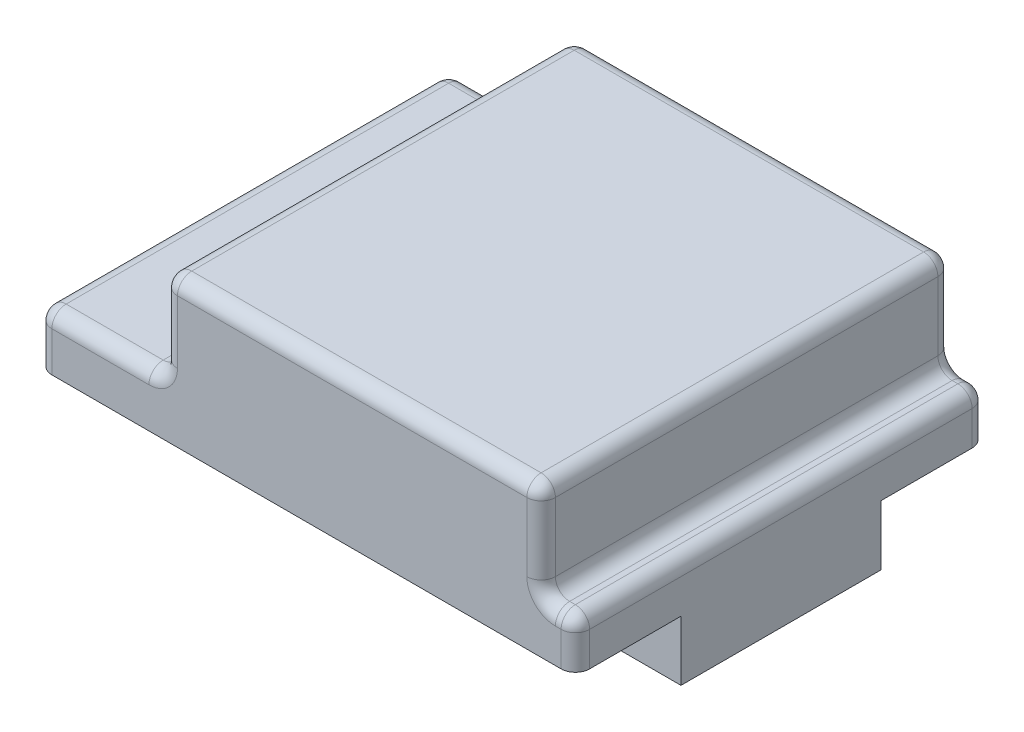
ISO-10303-21;
HEADER;
FILE_DESCRIPTION(('STEP AP214'),'2;1');
FILE_NAME('part.step','',(''),(''),'','','');
FILE_SCHEMA(('AUTOMOTIVE_DESIGN { 1 0 10303 214 1 1 1 1 }'));
ENDSEC;
DATA;
#1=APPLICATION_CONTEXT('core data for automotive mechanical design processes');
#2=APPLICATION_PROTOCOL_DEFINITION('international standard','automotive_design',2000,#1);
#3=PRODUCT_CONTEXT('',#1,'mechanical');
#4=PRODUCT('Part','Part','',(#3));
#5=PRODUCT_RELATED_PRODUCT_CATEGORY('part','',(#4));
#6=PRODUCT_DEFINITION_FORMATION('','',#4);
#7=PRODUCT_DEFINITION_CONTEXT('part definition',#1,'design');
#8=PRODUCT_DEFINITION('design','',#6,#7);
#9=PRODUCT_DEFINITION_SHAPE('','',#8);
#10=(LENGTH_UNIT() NAMED_UNIT(*) SI_UNIT(.MILLI.,.METRE.));
#11=(NAMED_UNIT(*) PLANE_ANGLE_UNIT() SI_UNIT($,.RADIAN.));
#12=(NAMED_UNIT(*) SI_UNIT($,.STERADIAN.) SOLID_ANGLE_UNIT());
#13=UNCERTAINTY_MEASURE_WITH_UNIT(LENGTH_MEASURE(1.E-05),#10,'distance_accuracy_value','');
#14=(GEOMETRIC_REPRESENTATION_CONTEXT(3) GLOBAL_UNCERTAINTY_ASSIGNED_CONTEXT((#13)) GLOBAL_UNIT_ASSIGNED_CONTEXT((#10,
#11,#12)) REPRESENTATION_CONTEXT('',''));
#15=CARTESIAN_POINT('',(0.,0.,0.));
#16=DIRECTION('',(0.,0.,1.));
#17=DIRECTION('',(1.,0.,0.));
#18=AXIS2_PLACEMENT_3D('',#15,#16,#17);
#19=CARTESIAN_POINT('',(188.4,-21.,37.));
#20=DIRECTION('',(0.,-1.,0.));
#21=DIRECTION('',(0.,0.,-1.));
#22=AXIS2_PLACEMENT_3D('',#19,#20,#21);
#23=PLANE('',#22);
#24=DIRECTION('',(-1.,0.,0.));
#25=VECTOR('',#24,1.);
#26=CARTESIAN_POINT('',(188.401025,-21.,93.));
#27=LINE('',#26,#25);
#28=CARTESIAN_POINT('',(129.4,-21.,93.));
#29=VERTEX_POINT('',#28);
#30=CARTESIAN_POINT('',(131.4,-21.,93.));
#31=VERTEX_POINT('',#30);
#32=EDGE_CURVE('E474',#29,#31,#27,.F.);
#33=ORIENTED_EDGE('',*,*,#32,.T.);
#34=DIRECTION('',(0.,0.,1.));
#35=VECTOR('',#34,1.);
#36=CARTESIAN_POINT('',(131.4,-21.,37.));
#37=LINE('',#36,#35);
#38=CARTESIAN_POINT('',(131.4,-21.,95.5));
#39=VERTEX_POINT('',#38);
#40=EDGE_CURVE('E464',#31,#39,#37,.T.);
#41=ORIENTED_EDGE('',*,*,#40,.T.);
#42=DIRECTION('',(1.,0.,0.));
#43=VECTOR('',#42,1.);
#44=CARTESIAN_POINT('',(131.4,-21.,95.5));
#45=LINE('',#44,#43);
#46=CARTESIAN_POINT('',(139.4,-21.,95.5));
#47=VERTEX_POINT('',#46);
#48=EDGE_CURVE('E456',#39,#47,#45,.T.);
#49=ORIENTED_EDGE('',*,*,#48,.T.);
#50=DIRECTION('',(0.,0.,1.));
#51=VECTOR('',#50,1.);
#52=CARTESIAN_POINT('',(139.4,-21.,37.));
#53=LINE('',#52,#51);
#54=CARTESIAN_POINT('',(139.4,-21.,93.));
#55=VERTEX_POINT('',#54);
#56=EDGE_CURVE('E440',#55,#47,#53,.T.);
#57=ORIENTED_EDGE('',*,*,#56,.F.);
#58=CARTESIAN_POINT('',(141.4,-21.,93.));
#59=VERTEX_POINT('',#58);
#60=EDGE_CURVE('E473',#55,#59,#27,.F.);
#61=ORIENTED_EDGE('',*,*,#60,.T.);
#62=DIRECTION('',(0.,0.,1.));
#63=VECTOR('',#62,1.);
#64=CARTESIAN_POINT('',(141.4,-21.,37.));
#65=LINE('',#64,#63);
#66=CARTESIAN_POINT('',(141.4,-21.,107.));
#67=VERTEX_POINT('',#66);
#68=EDGE_CURVE('E509',#59,#67,#65,.T.);
#69=ORIENTED_EDGE('',*,*,#68,.T.);
#70=DIRECTION('',(-1.,0.,0.));
#71=VECTOR('',#70,1.);
#72=CARTESIAN_POINT('',(141.4,-21.,107.));
#73=LINE('',#72,#71);
#74=CARTESIAN_POINT('',(129.4,-21.,107.));
#75=VERTEX_POINT('',#74);
#76=EDGE_CURVE('E503',#67,#75,#73,.T.);
#77=ORIENTED_EDGE('',*,*,#76,.T.);
#78=DIRECTION('',(0.,0.,-1.));
#79=VECTOR('',#78,1.);
#80=CARTESIAN_POINT('',(129.4,-21.,37.));
#81=LINE('',#80,#79);
#82=EDGE_CURVE('E498',#75,#29,#81,.T.);
#83=ORIENTED_EDGE('',*,*,#82,.T.);
#84=EDGE_LOOP('',(#33,#41,#49,#57,#61,#69,#77,#83));
#85=FACE_BOUND('',#84,.T.);
#86=ADVANCED_FACE('F30',(#85),#23,.T.);
#87=DIRECTION('',(1.,0.,0.));
#88=VECTOR('',#87,1.);
#89=CARTESIAN_POINT('',(131.4,-21.,48.5));
#90=LINE('',#89,#88);
#91=CARTESIAN_POINT('',(139.4,-21.,48.5));
#92=VERTEX_POINT('',#91);
#93=CARTESIAN_POINT('',(131.4,-21.,48.5));
#94=VERTEX_POINT('',#93);
#95=EDGE_CURVE('E459',#92,#94,#90,.F.);
#96=ORIENTED_EDGE('',*,*,#95,.T.);
#97=DIRECTION('',(0.,0.,1.));
#98=VECTOR('',#97,1.);
#99=CARTESIAN_POINT('',(131.4,-21.,37.));
#100=LINE('',#99,#98);
#101=CARTESIAN_POINT('',(131.4,-21.,51.));
#102=VERTEX_POINT('',#101);
#103=EDGE_CURVE('E450',#94,#102,#100,.T.);
#104=ORIENTED_EDGE('',*,*,#103,.T.);
#105=DIRECTION('',(-1.,0.,0.));
#106=VECTOR('',#105,1.);
#107=CARTESIAN_POINT('',(188.401025,-21.,51.));
#108=LINE('',#107,#106);
#109=CARTESIAN_POINT('',(129.4,-21.,51.));
#110=VERTEX_POINT('',#109);
#111=EDGE_CURVE('E465',#102,#110,#108,.T.);
#112=ORIENTED_EDGE('',*,*,#111,.T.);
#113=CARTESIAN_POINT('',(129.4,-21.,37.));
#114=VERTEX_POINT('',#113);
#115=EDGE_CURVE('E502',#110,#114,#81,.T.);
#116=ORIENTED_EDGE('',*,*,#115,.T.);
#117=DIRECTION('',(1.,0.,0.));
#118=VECTOR('',#117,1.);
#119=CARTESIAN_POINT('',(141.4,-21.,37.));
#120=LINE('',#119,#118);
#121=CARTESIAN_POINT('',(141.4,-21.,37.));
#122=VERTEX_POINT('',#121);
#123=EDGE_CURVE('E486',#114,#122,#120,.T.);
#124=ORIENTED_EDGE('',*,*,#123,.T.);
#125=CARTESIAN_POINT('',(141.4,-21.,51.));
#126=VERTEX_POINT('',#125);
#127=EDGE_CURVE('E506',#122,#126,#65,.T.);
#128=ORIENTED_EDGE('',*,*,#127,.T.);
#129=CARTESIAN_POINT('',(139.4,-21.,51.));
#130=VERTEX_POINT('',#129);
#131=EDGE_CURVE('E467',#126,#130,#108,.T.);
#132=ORIENTED_EDGE('',*,*,#131,.T.);
#133=DIRECTION('',(0.,0.,1.));
#134=VECTOR('',#133,1.);
#135=CARTESIAN_POINT('',(139.4,-21.,37.));
#136=LINE('',#135,#134);
#137=EDGE_CURVE('E451',#92,#130,#136,.T.);
#138=ORIENTED_EDGE('',*,*,#137,.F.);
#139=EDGE_LOOP('',(#96,#104,#112,#116,#124,#128,#132,#138));
#140=FACE_BOUND('',#139,.T.);
#141=ADVANCED_FACE('F875',(#140),#23,.T.);
#142=CARTESIAN_POINT('',(188.401025,-21.,72.));
#143=DIRECTION('',(-1.,0.,0.));
#144=DIRECTION('',(0.,0.,1.));
#145=AXIS2_PLACEMENT_3D('',#142,#143,#144);
#146=CYLINDRICAL_SURFACE('',#145,21.);
#147=CARTESIAN_POINT('',(131.4,-21.,72.));
#148=DIRECTION('',(1.,0.,0.));
#149=DIRECTION('',(0.,1.,0.));
#150=AXIS2_PLACEMENT_3D('',#147,#148,#149);
#151=CIRCLE('',#150,21.);
#152=EDGE_CURVE('E880',#31,#102,#151,.F.);
#153=ORIENTED_EDGE('',*,*,#152,.F.);
#154=ORIENTED_EDGE('',*,*,#32,.F.);
#155=CARTESIAN_POINT('',(129.4,-21.,72.));
#156=DIRECTION('',(-1.,0.,0.));
#157=DIRECTION('',(0.,0.,1.));
#158=AXIS2_PLACEMENT_3D('',#155,#156,#157);
#159=CIRCLE('',#158,21.);
#160=EDGE_CURVE('E476',#29,#110,#159,.T.);
#161=ORIENTED_EDGE('',*,*,#160,.T.);
#162=ORIENTED_EDGE('',*,*,#111,.F.);
#163=EDGE_LOOP('',(#153,#154,#161,#162));
#164=FACE_BOUND('',#163,.T.);
#165=ADVANCED_FACE('F879',(#164),#146,.F.);
#166=CARTESIAN_POINT('',(44.,36.,144.));
#167=DIRECTION('',(0.,-1.,0.));
#168=DIRECTION('',(0.,0.,-1.));
#169=AXIS2_PLACEMENT_3D('',#166,#167,#168);
#170=PLANE('',#169);
#171=DIRECTION('',(0.,0.,1.));
#172=VECTOR('',#171,1.);
#173=CARTESIAN_POINT('',(89.,36.,109.));
#174=LINE('',#173,#172);
#175=CARTESIAN_POINT('',(89.,36.,39.));
#176=VERTEX_POINT('',#175);
#177=CARTESIAN_POINT('',(89.,36.,109.));
#178=VERTEX_POINT('',#177);
#179=EDGE_CURVE('E556',#176,#178,#174,.T.);
#180=ORIENTED_EDGE('',*,*,#179,.F.);
#181=DIRECTION('',(1.,0.,0.));
#182=VECTOR('',#181,1.);
#183=CARTESIAN_POINT('',(89.,36.,39.));
#184=LINE('',#183,#182);
#185=CARTESIAN_POINT('',(79.,36.,39.));
#186=VERTEX_POINT('',#185);
#187=EDGE_CURVE('E579',#186,#176,#184,.T.);
#188=ORIENTED_EDGE('',*,*,#187,.F.);
#189=DIRECTION('',(0.,0.,-1.));
#190=VECTOR('',#189,1.);
#191=CARTESIAN_POINT('',(79.,36.,109.));
#192=LINE('',#191,#190);
#193=CARTESIAN_POINT('',(79.,36.,109.));
#194=VERTEX_POINT('',#193);
#195=EDGE_CURVE('E576',#194,#186,#192,.T.);
#196=ORIENTED_EDGE('',*,*,#195,.F.);
#197=DIRECTION('',(-1.,0.,0.));
#198=VECTOR('',#197,1.);
#199=CARTESIAN_POINT('',(89.,36.,109.));
#200=LINE('',#199,#198);
#201=EDGE_CURVE('E573',#178,#194,#200,.T.);
#202=ORIENTED_EDGE('',*,*,#201,.F.);
#203=EDGE_LOOP('',(#180,#188,#196,#202));
#204=FACE_BOUND('',#203,.T.);
#205=DIRECTION('',(-1.,0.,0.));
#206=VECTOR('',#205,1.);
#207=CARTESIAN_POINT('',(0.,36.,15.));
#208=LINE('',#207,#206);
#209=CARTESIAN_POINT('',(161.4,36.,15.));
#210=VERTEX_POINT('',#209);
#211=CARTESIAN_POINT('',(59.,36.,15.));
#212=VERTEX_POINT('',#211);
#213=EDGE_CURVE('E676',#210,#212,#208,.T.);
#214=ORIENTED_EDGE('',*,*,#213,.F.);
#215=DIRECTION('',(0.,0.,-1.));
#216=VECTOR('',#215,1.);
#217=CARTESIAN_POINT('',(161.4,36.,144.));
#218=LINE('',#217,#216);
#219=CARTESIAN_POINT('',(161.4,36.,129.));
#220=VERTEX_POINT('',#219);
#221=EDGE_CURVE('E681',#220,#210,#218,.T.);
#222=ORIENTED_EDGE('',*,*,#221,.F.);
#223=DIRECTION('',(-1.,0.,0.));
#224=VECTOR('',#223,1.);
#225=CARTESIAN_POINT('',(0.,36.,129.));
#226=LINE('',#225,#224);
#227=CARTESIAN_POINT('',(59.,36.,129.));
#228=VERTEX_POINT('',#227);
#229=EDGE_CURVE('E678',#220,#228,#226,.T.);
#230=ORIENTED_EDGE('',*,*,#229,.T.);
#231=DIRECTION('',(0.,0.,-1.));
#232=VECTOR('',#231,1.);
#233=CARTESIAN_POINT('',(59.,36.,144.));
#234=LINE('',#233,#232);
#235=EDGE_CURVE('E673',#228,#212,#234,.T.);
#236=ORIENTED_EDGE('',*,*,#235,.T.);
#237=EDGE_LOOP('',(#214,#222,#230,#236));
#238=FACE_BOUND('',#237,.T.);
#239=DIRECTION('',(-1.,0.,0.));
#240=VECTOR('',#239,1.);
#241=CARTESIAN_POINT('',(141.4,36.,107.));
#242=LINE('',#241,#240);
#243=CARTESIAN_POINT('',(141.4,36.,107.));
#244=VERTEX_POINT('',#243);
#245=CARTESIAN_POINT('',(129.4,36.,107.));
#246=VERTEX_POINT('',#245);
#247=EDGE_CURVE('E491',#244,#246,#242,.T.);
#248=ORIENTED_EDGE('',*,*,#247,.F.);
#249=DIRECTION('',(0.,0.,1.));
#250=VECTOR('',#249,1.);
#251=CARTESIAN_POINT('',(141.4,36.,37.));
#252=LINE('',#251,#250);
#253=CARTESIAN_POINT('',(141.4,36.,37.));
#254=VERTEX_POINT('',#253);
#255=EDGE_CURVE('E495',#254,#244,#252,.T.);
#256=ORIENTED_EDGE('',*,*,#255,.F.);
#257=DIRECTION('',(1.,0.,0.));
#258=VECTOR('',#257,1.);
#259=CARTESIAN_POINT('',(141.4,36.,37.));
#260=LINE('',#259,#258);
#261=CARTESIAN_POINT('',(129.4,36.,37.));
#262=VERTEX_POINT('',#261);
#263=EDGE_CURVE('E483',#262,#254,#260,.T.);
#264=ORIENTED_EDGE('',*,*,#263,.F.);
#265=DIRECTION('',(0.,0.,-1.));
#266=VECTOR('',#265,1.);
#267=CARTESIAN_POINT('',(129.4,36.,37.));
#268=LINE('',#267,#266);
#269=EDGE_CURVE('E488',#246,#262,#268,.T.);
#270=ORIENTED_EDGE('',*,*,#269,.F.);
#271=EDGE_LOOP('',(#248,#256,#264,#270));
#272=FACE_BOUND('',#271,.T.);
#273=ADVANCED_FACE('F1272',(#204,#238,#272),#170,.T.);
#274=CARTESIAN_POINT('',(173.4,17.,144.));
#275=DIRECTION('',(-1.,0.,0.));
#276=DIRECTION('',(0.,0.,1.));
#277=AXIS2_PLACEMENT_3D('',#274,#275,#276);
#278=PLANE('',#277);
#279=DIRECTION('',(0.,1.,0.));
#280=VECTOR('',#279,1.);
#281=CARTESIAN_POINT('',(173.4,500000.,37.));
#282=LINE('',#281,#280);
#283=CARTESIAN_POINT('',(173.4,0.,37.));
#284=VERTEX_POINT('',#283);
#285=CARTESIAN_POINT('',(173.4,2.,37.));
#286=VERTEX_POINT('',#285);
#287=EDGE_CURVE('E533',#284,#286,#282,.T.);
#288=ORIENTED_EDGE('',*,*,#287,.T.);
#289=DIRECTION('',(0.,0.,-1.));
#290=VECTOR('',#289,1.);
#291=CARTESIAN_POINT('',(173.4,2.,144.));
#292=LINE('',#291,#290);
#293=CARTESIAN_POINT('',(173.4,2.,15.));
#294=VERTEX_POINT('',#293);
#295=EDGE_CURVE('E695',#286,#294,#292,.T.);
#296=ORIENTED_EDGE('',*,*,#295,.T.);
#297=DIRECTION('',(0.,1.,0.));
#298=VECTOR('',#297,1.);
#299=CARTESIAN_POINT('',(173.4,19.,15.));
#300=LINE('',#299,#298);
#301=CARTESIAN_POINT('',(173.4,0.,15.));
#302=VERTEX_POINT('',#301);
#303=EDGE_CURVE('E698',#302,#294,#300,.T.);
#304=ORIENTED_EDGE('',*,*,#303,.F.);
#305=DIRECTION('',(0.,0.,-1.));
#306=VECTOR('',#305,1.);
#307=CARTESIAN_POINT('',(173.4,0.,144.));
#308=LINE('',#307,#306);
#309=EDGE_CURVE('E704',#284,#302,#308,.T.);
#310=ORIENTED_EDGE('',*,*,#309,.F.);
#311=EDGE_LOOP('',(#288,#296,#304,#310));
#312=FACE_BOUND('',#311,.T.);
#313=ADVANCED_FACE('F1262',(#312),#278,.T.);
#314=CARTESIAN_POINT('',(176.4,2.,144.));
#315=DIRECTION('',(0.,-1.,0.));
#316=DIRECTION('',(0.,0.,-1.));
#317=AXIS2_PLACEMENT_3D('',#314,#315,#316);
#318=PLANE('',#317);
#319=DIRECTION('',(-1.,0.,0.));
#320=VECTOR('',#319,1.);
#321=CARTESIAN_POINT('',(161.4,2.00000000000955,37.));
#322=LINE('',#321,#320);
#323=CARTESIAN_POINT('',(161.4,2.00000000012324,37.));
#324=VERTEX_POINT('',#323);
#325=EDGE_CURVE('E541',#286,#324,#322,.T.);
#326=ORIENTED_EDGE('',*,*,#325,.T.);
#327=DIRECTION('',(0.,0.,-1.));
#328=VECTOR('',#327,1.);
#329=CARTESIAN_POINT('',(161.4,2.,144.));
#330=LINE('',#329,#328);
#331=CARTESIAN_POINT('',(161.4,2.,15.));
#332=VERTEX_POINT('',#331);
#333=EDGE_CURVE('E688',#324,#332,#330,.T.);
#334=ORIENTED_EDGE('',*,*,#333,.T.);
#335=DIRECTION('',(-1.,0.,0.));
#336=VECTOR('',#335,1.);
#337=CARTESIAN_POINT('',(0.,2.,15.));
#338=LINE('',#337,#336);
#339=EDGE_CURVE('E690',#294,#332,#338,.T.);
#340=ORIENTED_EDGE('',*,*,#339,.F.);
#341=ORIENTED_EDGE('',*,*,#295,.F.);
#342=EDGE_LOOP('',(#326,#334,#340,#341));
#343=FACE_BOUND('',#342,.T.);
#344=ADVANCED_FACE('F1267',(#343),#318,.T.);
#345=CARTESIAN_POINT('',(59.,-25.,39.));
#346=DIRECTION('',(0.,1.,0.));
#347=DIRECTION('',(0.,0.,1.));
#348=AXIS2_PLACEMENT_3D('',#345,#346,#347);
#349=PLANE('',#348);
#350=DIRECTION('',(0.,0.,1.));
#351=VECTOR('',#350,1.);
#352=CARTESIAN_POINT('',(79.,-25.,109.));
#353=LINE('',#352,#351);
#354=CARTESIAN_POINT('',(79.,-25.,97.5));
#355=VERTEX_POINT('',#354);
#356=CARTESIAN_POINT('',(79.,-25.,109.));
#357=VERTEX_POINT('',#356);
#358=EDGE_CURVE('E563',#355,#357,#353,.T.);
#359=ORIENTED_EDGE('',*,*,#358,.F.);
#360=DIRECTION('',(1.,0.,0.));
#361=VECTOR('',#360,1.);
#362=CARTESIAN_POINT('',(-0.00100000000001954,-25.,97.5));
#363=LINE('',#362,#361);
#364=CARTESIAN_POINT('',(89.,-25.,97.5));
#365=VERTEX_POINT('',#364);
#366=EDGE_CURVE('E544',#365,#355,#363,.F.);
#367=ORIENTED_EDGE('',*,*,#366,.F.);
#368=DIRECTION('',(0.,0.,-1.));
#369=VECTOR('',#368,1.);
#370=CARTESIAN_POINT('',(89.,-25.,109.));
#371=LINE('',#370,#369);
#372=CARTESIAN_POINT('',(89.,-25.,109.));
#373=VERTEX_POINT('',#372);
#374=EDGE_CURVE('E567',#373,#365,#371,.T.);
#375=ORIENTED_EDGE('',*,*,#374,.F.);
#376=DIRECTION('',(1.,0.,0.));
#377=VECTOR('',#376,1.);
#378=CARTESIAN_POINT('',(89.,-25.,109.));
#379=LINE('',#378,#377);
#380=EDGE_CURVE('E562',#357,#373,#379,.T.);
#381=ORIENTED_EDGE('',*,*,#380,.F.);
#382=EDGE_LOOP('',(#359,#367,#375,#381));
#383=FACE_BOUND('',#382,.T.);
#384=ADVANCED_FACE('F1201',(#383),#349,.F.);
#385=CARTESIAN_POINT('',(59.,-25.,39.));
#386=DIRECTION('',(0.,1.,0.));
#387=DIRECTION('',(0.,0.,1.));
#388=AXIS2_PLACEMENT_3D('',#385,#386,#387);
#389=PLANE('',#388);
#390=DIRECTION('',(0.,0.,1.));
#391=VECTOR('',#390,1.);
#392=CARTESIAN_POINT('',(57.,-25.,39.));
#393=LINE('',#392,#391);
#394=CARTESIAN_POINT('',(57.,-25.,50.5));
#395=VERTEX_POINT('',#394);
#396=CARTESIAN_POINT('',(57.,-25.,53.));
#397=VERTEX_POINT('',#396);
#398=EDGE_CURVE('E606',#395,#397,#393,.T.);
#399=ORIENTED_EDGE('',*,*,#398,.F.);
#400=DIRECTION('',(-1.,0.,0.));
#401=VECTOR('',#400,1.);
#402=CARTESIAN_POINT('',(57.,-25.,50.5));
#403=LINE('',#402,#401);
#404=CARTESIAN_POINT('',(49.,-25.,50.5));
#405=VERTEX_POINT('',#404);
#406=EDGE_CURVE('E608',#395,#405,#403,.T.);
#407=ORIENTED_EDGE('',*,*,#406,.T.);
#408=DIRECTION('',(0.,0.,1.));
#409=VECTOR('',#408,1.);
#410=CARTESIAN_POINT('',(49.,-25.,39.));
#411=LINE('',#410,#409);
#412=CARTESIAN_POINT('',(49.,-25.,53.));
#413=VERTEX_POINT('',#412);
#414=EDGE_CURVE('E601',#405,#413,#411,.T.);
#415=ORIENTED_EDGE('',*,*,#414,.T.);
#416=DIRECTION('',(-1.,0.,0.));
#417=VECTOR('',#416,1.);
#418=CARTESIAN_POINT('',(188.401,-25.,53.));
#419=LINE('',#418,#417);
#420=CARTESIAN_POINT('',(47.,-25.,53.));
#421=VERTEX_POINT('',#420);
#422=EDGE_CURVE('E616',#421,#413,#419,.F.);
#423=ORIENTED_EDGE('',*,*,#422,.F.);
#424=DIRECTION('',(0.,0.,-1.));
#425=VECTOR('',#424,1.);
#426=CARTESIAN_POINT('',(47.,-25.,109.));
#427=LINE('',#426,#425);
#428=CARTESIAN_POINT('',(47.,-25.,39.));
#429=VERTEX_POINT('',#428);
#430=EDGE_CURVE('E637',#421,#429,#427,.T.);
#431=ORIENTED_EDGE('',*,*,#430,.T.);
#432=DIRECTION('',(1.,0.,0.));
#433=VECTOR('',#432,1.);
#434=CARTESIAN_POINT('',(59.,-25.,39.));
#435=LINE('',#434,#433);
#436=CARTESIAN_POINT('',(59.,-25.,39.));
#437=VERTEX_POINT('',#436);
#438=EDGE_CURVE('E641',#429,#437,#435,.T.);
#439=ORIENTED_EDGE('',*,*,#438,.T.);
#440=DIRECTION('',(0.,0.,1.));
#441=VECTOR('',#440,1.);
#442=CARTESIAN_POINT('',(59.,-25.,109.));
#443=LINE('',#442,#441);
#444=CARTESIAN_POINT('',(59.,-25.,53.));
#445=VERTEX_POINT('',#444);
#446=EDGE_CURVE('E632',#437,#445,#443,.T.);
#447=ORIENTED_EDGE('',*,*,#446,.T.);
#448=EDGE_CURVE('E615',#397,#445,#419,.F.);
#449=ORIENTED_EDGE('',*,*,#448,.F.);
#450=EDGE_LOOP('',(#399,#407,#415,#423,#431,#439,#447,#449));
#451=FACE_BOUND('',#450,.T.);
#452=ADVANCED_FACE('F1235',(#451),#389,.F.);
#453=DIRECTION('',(0.,0.,1.));
#454=VECTOR('',#453,1.);
#455=CARTESIAN_POINT('',(57.,-25.,39.));
#456=LINE('',#455,#454);
#457=CARTESIAN_POINT('',(57.,-25.,95.));
#458=VERTEX_POINT('',#457);
#459=CARTESIAN_POINT('',(57.,-25.,97.5));
#460=VERTEX_POINT('',#459);
#461=EDGE_CURVE('E604',#458,#460,#456,.T.);
#462=ORIENTED_EDGE('',*,*,#461,.F.);
#463=DIRECTION('',(-1.,0.,0.));
#464=VECTOR('',#463,1.);
#465=CARTESIAN_POINT('',(188.401,-25.,95.));
#466=LINE('',#465,#464);
#467=CARTESIAN_POINT('',(59.,-25.,95.));
#468=VERTEX_POINT('',#467);
#469=EDGE_CURVE('E612',#468,#458,#466,.T.);
#470=ORIENTED_EDGE('',*,*,#469,.F.);
#471=CARTESIAN_POINT('',(59.,-25.,109.));
#472=VERTEX_POINT('',#471);
#473=EDGE_CURVE('E631',#468,#472,#443,.T.);
#474=ORIENTED_EDGE('',*,*,#473,.T.);
#475=DIRECTION('',(-1.,0.,0.));
#476=VECTOR('',#475,1.);
#477=CARTESIAN_POINT('',(59.,-25.,109.));
#478=LINE('',#477,#476);
#479=CARTESIAN_POINT('',(47.,-25.,109.));
#480=VERTEX_POINT('',#479);
#481=EDGE_CURVE('E635',#472,#480,#478,.T.);
#482=ORIENTED_EDGE('',*,*,#481,.T.);
#483=CARTESIAN_POINT('',(47.,-25.,95.));
#484=VERTEX_POINT('',#483);
#485=EDGE_CURVE('E638',#480,#484,#427,.T.);
#486=ORIENTED_EDGE('',*,*,#485,.T.);
#487=CARTESIAN_POINT('',(49.,-25.,95.));
#488=VERTEX_POINT('',#487);
#489=EDGE_CURVE('E611',#488,#484,#466,.T.);
#490=ORIENTED_EDGE('',*,*,#489,.F.);
#491=DIRECTION('',(0.,0.,1.));
#492=VECTOR('',#491,1.);
#493=CARTESIAN_POINT('',(49.,-25.,39.));
#494=LINE('',#493,#492);
#495=CARTESIAN_POINT('',(49.,-25.,97.5));
#496=VERTEX_POINT('',#495);
#497=EDGE_CURVE('E598',#488,#496,#494,.T.);
#498=ORIENTED_EDGE('',*,*,#497,.T.);
#499=DIRECTION('',(-1.,0.,0.));
#500=VECTOR('',#499,1.);
#501=CARTESIAN_POINT('',(57.,-25.,97.5));
#502=LINE('',#501,#500);
#503=EDGE_CURVE('E723',#496,#460,#502,.F.);
#504=ORIENTED_EDGE('',*,*,#503,.T.);
#505=EDGE_LOOP('',(#462,#470,#474,#482,#486,#490,#498,#504));
#506=FACE_BOUND('',#505,.T.);
#507=ADVANCED_FACE('F1238',(#506),#389,.F.);
#508=CARTESIAN_POINT('',(188.401,-25.,74.));
#509=DIRECTION('',(-1.,0.,0.));
#510=DIRECTION('',(0.,0.,1.));
#511=AXIS2_PLACEMENT_3D('',#508,#509,#510);
#512=CYLINDRICAL_SURFACE('',#511,21.);
#513=CARTESIAN_POINT('',(57.,-25.,74.));
#514=DIRECTION('',(-1.,0.,0.));
#515=DIRECTION('',(0.,0.,1.));
#516=AXIS2_PLACEMENT_3D('',#513,#514,#515);
#517=CIRCLE('',#516,21.);
#518=EDGE_CURVE('E727',#397,#458,#517,.F.);
#519=ORIENTED_EDGE('',*,*,#518,.F.);
#520=ORIENTED_EDGE('',*,*,#448,.T.);
#521=CARTESIAN_POINT('',(59.,-25.,74.));
#522=DIRECTION('',(1.,0.,0.));
#523=DIRECTION('',(0.,0.,-1.));
#524=AXIS2_PLACEMENT_3D('',#521,#522,#523);
#525=CIRCLE('',#524,21.);
#526=EDGE_CURVE('E621',#468,#445,#525,.F.);
#527=ORIENTED_EDGE('',*,*,#526,.F.);
#528=ORIENTED_EDGE('',*,*,#469,.T.);
#529=EDGE_LOOP('',(#519,#520,#527,#528));
#530=FACE_BOUND('',#529,.T.);
#531=ADVANCED_FACE('F1234',(#530),#512,.F.);
#532=CARTESIAN_POINT('',(0.,4.,144.));
#533=DIRECTION('',(0.,-1.,0.));
#534=DIRECTION('',(0.,0.,-1.));
#535=AXIS2_PLACEMENT_3D('',#532,#533,#534);
#536=PLANE('',#535);
#537=DIRECTION('',(0.,0.,-1.));
#538=VECTOR('',#537,1.);
#539=CARTESIAN_POINT('',(47.,4.,109.));
#540=LINE('',#539,#538);
#541=CARTESIAN_POINT('',(47.,4.,109.));
#542=VERTEX_POINT('',#541);
#543=CARTESIAN_POINT('',(47.,4.,39.));
#544=VERTEX_POINT('',#543);
#545=EDGE_CURVE('E626',#542,#544,#540,.T.);
#546=ORIENTED_EDGE('',*,*,#545,.F.);
#547=DIRECTION('',(-1.,0.,0.));
#548=VECTOR('',#547,1.);
#549=CARTESIAN_POINT('',(59.,4.,109.));
#550=LINE('',#549,#548);
#551=CARTESIAN_POINT('',(59.,4.,109.));
#552=VERTEX_POINT('',#551);
#553=EDGE_CURVE('E624',#552,#542,#550,.T.);
#554=ORIENTED_EDGE('',*,*,#553,.F.);
#555=DIRECTION('',(0.,0.,-1.));
#556=VECTOR('',#555,1.);
#557=CARTESIAN_POINT('',(59.,4.,144.));
#558=LINE('',#557,#556);
#559=CARTESIAN_POINT('',(59.,4.,129.));
#560=VERTEX_POINT('',#559);
#561=EDGE_CURVE('E670',#560,#552,#558,.T.);
#562=ORIENTED_EDGE('',*,*,#561,.F.);
#563=DIRECTION('',(-1.,0.,0.));
#564=VECTOR('',#563,1.);
#565=CARTESIAN_POINT('',(0.,4.,129.));
#566=LINE('',#565,#564);
#567=CARTESIAN_POINT('',(15.,4.,129.));
#568=VERTEX_POINT('',#567);
#569=EDGE_CURVE('E665',#560,#568,#566,.T.);
#570=ORIENTED_EDGE('',*,*,#569,.T.);
#571=DIRECTION('',(0.,0.,-1.));
#572=VECTOR('',#571,1.);
#573=CARTESIAN_POINT('',(15.,4.,144.));
#574=LINE('',#573,#572);
#575=CARTESIAN_POINT('',(15.,4.,15.));
#576=VERTEX_POINT('',#575);
#577=EDGE_CURVE('E661',#568,#576,#574,.T.);
#578=ORIENTED_EDGE('',*,*,#577,.T.);
#579=DIRECTION('',(-1.,0.,0.));
#580=VECTOR('',#579,1.);
#581=CARTESIAN_POINT('',(0.,4.,15.));
#582=LINE('',#581,#580);
#583=CARTESIAN_POINT('',(59.,4.,15.));
#584=VERTEX_POINT('',#583);
#585=EDGE_CURVE('E660',#584,#576,#582,.T.);
#586=ORIENTED_EDGE('',*,*,#585,.F.);
#587=CARTESIAN_POINT('',(59.,4.,39.));
#588=VERTEX_POINT('',#587);
#589=EDGE_CURVE('E664',#588,#584,#558,.T.);
#590=ORIENTED_EDGE('',*,*,#589,.F.);
#591=DIRECTION('',(1.,0.,0.));
#592=VECTOR('',#591,1.);
#593=CARTESIAN_POINT('',(59.,4.,39.));
#594=LINE('',#593,#592);
#595=EDGE_CURVE('E629',#544,#588,#594,.T.);
#596=ORIENTED_EDGE('',*,*,#595,.F.);
#597=EDGE_LOOP('',(#546,#554,#562,#570,#578,#586,#590,#596));
#598=FACE_BOUND('',#597,.T.);
#599=ADVANCED_FACE('F1280',(#598),#536,.T.);
#600=CARTESIAN_POINT('',(0.,0.,144.));
#601=DIRECTION('',(0.,1.,0.));
#602=DIRECTION('',(0.,0.,1.));
#603=AXIS2_PLACEMENT_3D('',#600,#601,#602);
#604=PLANE('',#603);
#605=DIRECTION('',(0.,0.,-1.));
#606=VECTOR('',#605,1.);
#607=CARTESIAN_POINT('',(0.,0.,144.));
#608=LINE('',#607,#606);
#609=CARTESIAN_POINT('',(0.,0.,139.));
#610=VERTEX_POINT('',#609);
#611=CARTESIAN_POINT('',(0.,0.,5.));
#612=VERTEX_POINT('',#611);
#613=EDGE_CURVE('E732',#610,#612,#608,.T.);
#614=ORIENTED_EDGE('',*,*,#613,.T.);
#615=CARTESIAN_POINT('',(5.,0.,5.));
#616=DIRECTION('',(0.,1.,0.));
#617=DIRECTION('',(0.,0.,1.));
#618=AXIS2_PLACEMENT_3D('',#615,#616,#617);
#619=CIRCLE('',#618,5.);
#620=CARTESIAN_POINT('',(5.,0.,0.));
#621=VERTEX_POINT('',#620);
#622=EDGE_CURVE('E748',#612,#621,#619,.F.);
#623=ORIENTED_EDGE('',*,*,#622,.T.);
#624=DIRECTION('',(1.,0.,0.));
#625=VECTOR('',#624,1.);
#626=CARTESIAN_POINT('',(0.,0.,0.));
#627=LINE('',#626,#625);
#628=CARTESIAN_POINT('',(183.4,0.,0.));
#629=VERTEX_POINT('',#628);
#630=EDGE_CURVE('E710',#621,#629,#627,.T.);
#631=ORIENTED_EDGE('',*,*,#630,.T.);
#632=CARTESIAN_POINT('',(183.4,0.,5.));
#633=DIRECTION('',(0.,1.,0.));
#634=DIRECTION('',(0.,0.,1.));
#635=AXIS2_PLACEMENT_3D('',#632,#633,#634);
#636=CIRCLE('',#635,5.);
#637=CARTESIAN_POINT('',(188.4,0.,5.));
#638=VERTEX_POINT('',#637);
#639=EDGE_CURVE('E745',#629,#638,#636,.F.);
#640=ORIENTED_EDGE('',*,*,#639,.T.);
#641=DIRECTION('',(0.,0.,-1.));
#642=VECTOR('',#641,1.);
#643=CARTESIAN_POINT('',(188.4,0.,144.));
#644=LINE('',#643,#642);
#645=CARTESIAN_POINT('',(188.4,0.,37.));
#646=VERTEX_POINT('',#645);
#647=EDGE_CURVE('E737',#646,#638,#644,.T.);
#648=ORIENTED_EDGE('',*,*,#647,.F.);
#649=DIRECTION('',(1.,0.,0.));
#650=VECTOR('',#649,1.);
#651=CARTESIAN_POINT('',(161.4,0.,37.));
#652=LINE('',#651,#650);
#653=EDGE_CURVE('E529',#284,#646,#652,.T.);
#654=ORIENTED_EDGE('',*,*,#653,.F.);
#655=ORIENTED_EDGE('',*,*,#309,.T.);
#656=DIRECTION('',(1.,0.,0.));
#657=VECTOR('',#656,1.);
#658=CARTESIAN_POINT('',(0.,0.,15.));
#659=LINE('',#658,#657);
#660=CARTESIAN_POINT('',(15.,0.,15.));
#661=VERTEX_POINT('',#660);
#662=EDGE_CURVE('E656',#661,#302,#659,.T.);
#663=ORIENTED_EDGE('',*,*,#662,.F.);
#664=DIRECTION('',(0.,0.,-1.));
#665=VECTOR('',#664,1.);
#666=CARTESIAN_POINT('',(15.,0.,144.));
#667=LINE('',#666,#665);
#668=CARTESIAN_POINT('',(15.,0.,129.));
#669=VERTEX_POINT('',#668);
#670=EDGE_CURVE('E708',#669,#661,#667,.T.);
#671=ORIENTED_EDGE('',*,*,#670,.F.);
#672=DIRECTION('',(1.,0.,0.));
#673=VECTOR('',#672,1.);
#674=CARTESIAN_POINT('',(0.,0.,129.));
#675=LINE('',#674,#673);
#676=CARTESIAN_POINT('',(173.4,0.,129.));
#677=VERTEX_POINT('',#676);
#678=EDGE_CURVE('E659',#669,#677,#675,.T.);
#679=ORIENTED_EDGE('',*,*,#678,.T.);
#680=CARTESIAN_POINT('',(173.4,0.,107.));
#681=VERTEX_POINT('',#680);
#682=EDGE_CURVE('E711',#677,#681,#308,.T.);
#683=ORIENTED_EDGE('',*,*,#682,.T.);
#684=DIRECTION('',(-1.,0.,0.));
#685=VECTOR('',#684,1.);
#686=CARTESIAN_POINT('',(188.4,0.,107.));
#687=LINE('',#686,#685);
#688=CARTESIAN_POINT('',(188.4,0.,107.));
#689=VERTEX_POINT('',#688);
#690=EDGE_CURVE('E520',#689,#681,#687,.T.);
#691=ORIENTED_EDGE('',*,*,#690,.F.);
#692=CARTESIAN_POINT('',(188.4,0.,139.));
#693=VERTEX_POINT('',#692);
#694=EDGE_CURVE('E735',#693,#689,#644,.T.);
#695=ORIENTED_EDGE('',*,*,#694,.F.);
#696=CARTESIAN_POINT('',(183.4,0.,139.));
#697=DIRECTION('',(0.,1.,0.));
#698=DIRECTION('',(0.,0.,1.));
#699=AXIS2_PLACEMENT_3D('',#696,#697,#698);
#700=CIRCLE('',#699,5.);
#701=CARTESIAN_POINT('',(183.4,0.,144.));
#702=VERTEX_POINT('',#701);
#703=EDGE_CURVE('E759',#693,#702,#700,.F.);
#704=ORIENTED_EDGE('',*,*,#703,.T.);
#705=DIRECTION('',(1.,0.,0.));
#706=VECTOR('',#705,1.);
#707=CARTESIAN_POINT('',(0.,0.,144.));
#708=LINE('',#707,#706);
#709=CARTESIAN_POINT('',(5.,0.,144.));
#710=VERTEX_POINT('',#709);
#711=EDGE_CURVE('E738',#710,#702,#708,.T.);
#712=ORIENTED_EDGE('',*,*,#711,.F.);
#713=CARTESIAN_POINT('',(5.,0.,139.));
#714=DIRECTION('',(0.,1.,0.));
#715=DIRECTION('',(0.,0.,1.));
#716=AXIS2_PLACEMENT_3D('',#713,#714,#715);
#717=CIRCLE('',#716,5.);
#718=EDGE_CURVE('E763',#710,#610,#717,.F.);
#719=ORIENTED_EDGE('',*,*,#718,.T.);
#720=EDGE_LOOP('',(#614,#623,#631,#640,#648,#654,#655,#663,#671,#679,#683,#691,#695,#704,#712,#719));
#721=FACE_BOUND('',#720,.T.);
#722=ADVANCED_FACE('F744',(#721),#604,.F.);
#723=CARTESIAN_POINT('',(0.,0.,144.));
#724=DIRECTION('',(1.,0.,0.));
#725=DIRECTION('',(0.,0.,-1.));
#726=AXIS2_PLACEMENT_3D('',#723,#724,#725);
#727=PLANE('',#726);
#728=DIRECTION('',(0.,0.,-1.));
#729=VECTOR('',#728,1.);
#730=CARTESIAN_POINT('',(0.,14.,144.));
#731=LINE('',#730,#729);
#732=CARTESIAN_POINT('',(0.,14.,139.));
#733=VERTEX_POINT('',#732);
#734=CARTESIAN_POINT('',(0.,14.,5.));
#735=VERTEX_POINT('',#734);
#736=EDGE_CURVE('E778',#733,#735,#731,.T.);
#737=ORIENTED_EDGE('',*,*,#736,.T.);
#738=DIRECTION('',(0.,-1.,0.));
#739=VECTOR('',#738,1.);
#740=CARTESIAN_POINT('',(0.,0.,5.));
#741=LINE('',#740,#739);
#742=EDGE_CURVE('E989',#735,#612,#741,.T.);
#743=ORIENTED_EDGE('',*,*,#742,.T.);
#744=ORIENTED_EDGE('',*,*,#613,.F.);
#745=DIRECTION('',(0.,-1.,0.));
#746=VECTOR('',#745,1.);
#747=CARTESIAN_POINT('',(0.,0.,139.));
#748=LINE('',#747,#746);
#749=EDGE_CURVE('E987',#610,#733,#748,.F.);
#750=ORIENTED_EDGE('',*,*,#749,.T.);
#751=EDGE_LOOP('',(#737,#743,#744,#750));
#752=FACE_BOUND('',#751,.T.);
#753=ADVANCED_FACE('F32',(#752),#727,.F.);
#754=CARTESIAN_POINT('',(188.4,17.,144.));
#755=DIRECTION('',(-1.,0.,0.));
#756=DIRECTION('',(0.,0.,1.));
#757=AXIS2_PLACEMENT_3D('',#754,#755,#756);
#758=PLANE('',#757);
#759=ORIENTED_EDGE('',*,*,#647,.T.);
#760=DIRECTION('',(0.,1.,0.));
#761=VECTOR('',#760,1.);
#762=CARTESIAN_POINT('',(188.4,17.,5.));
#763=LINE('',#762,#761);
#764=CARTESIAN_POINT('',(188.4,12.,5.));
#765=VERTEX_POINT('',#764);
#766=EDGE_CURVE('E758',#638,#765,#763,.T.);
#767=ORIENTED_EDGE('',*,*,#766,.T.);
#768=DIRECTION('',(0.,0.,-1.));
#769=VECTOR('',#768,1.);
#770=CARTESIAN_POINT('',(188.4,12.,144.));
#771=LINE('',#770,#769);
#772=CARTESIAN_POINT('',(188.4,12.,139.));
#773=VERTEX_POINT('',#772);
#774=EDGE_CURVE('E974',#765,#773,#771,.F.);
#775=ORIENTED_EDGE('',*,*,#774,.T.);
#776=DIRECTION('',(0.,1.,0.));
#777=VECTOR('',#776,1.);
#778=CARTESIAN_POINT('',(188.4,17.,139.));
#779=LINE('',#778,#777);
#780=EDGE_CURVE('E972',#773,#693,#779,.F.);
#781=ORIENTED_EDGE('',*,*,#780,.T.);
#782=ORIENTED_EDGE('',*,*,#694,.T.);
#783=DIRECTION('',(0.,1.,0.));
#784=VECTOR('',#783,1.);
#785=CARTESIAN_POINT('',(188.4,-21.,107.));
#786=LINE('',#785,#784);
#787=CARTESIAN_POINT('',(188.4,-21.,107.));
#788=VERTEX_POINT('',#787);
#789=EDGE_CURVE('E539',#788,#689,#786,.T.);
#790=ORIENTED_EDGE('',*,*,#789,.F.);
#791=DIRECTION('',(0.,0.,1.));
#792=VECTOR('',#791,1.);
#793=CARTESIAN_POINT('',(188.4,-21.,107.));
#794=LINE('',#793,#792);
#795=CARTESIAN_POINT('',(188.4,-21.,37.));
#796=VERTEX_POINT('',#795);
#797=EDGE_CURVE('E1135',#796,#788,#794,.T.);
#798=ORIENTED_EDGE('',*,*,#797,.F.);
#799=DIRECTION('',(0.,1.,0.));
#800=VECTOR('',#799,1.);
#801=CARTESIAN_POINT('',(188.4,-21.,37.));
#802=LINE('',#801,#800);
#803=EDGE_CURVE('E1125',#796,#646,#802,.T.);
#804=ORIENTED_EDGE('',*,*,#803,.T.);
#805=EDGE_LOOP('',(#759,#767,#775,#781,#782,#790,#798,#804));
#806=FACE_BOUND('',#805,.T.);
#807=ADVANCED_FACE('F1113',(#806),#758,.F.);
#808=CARTESIAN_POINT('',(176.4,17.,144.));
#809=DIRECTION('',(0.,-1.,0.));
#810=DIRECTION('',(0.,0.,-1.));
#811=AXIS2_PLACEMENT_3D('',#808,#809,#810);
#812=PLANE('',#811);
#813=DIRECTION('',(-1.,0.,0.));
#814=VECTOR('',#813,1.);
#815=CARTESIAN_POINT('',(176.4,17.,139.));
#816=LINE('',#815,#814);
#817=CARTESIAN_POINT('',(181.4,17.,139.));
#818=VERTEX_POINT('',#817);
#819=CARTESIAN_POINT('',(183.4,17.,139.));
#820=VERTEX_POINT('',#819);
#821=EDGE_CURVE('E967',#818,#820,#816,.F.);
#822=ORIENTED_EDGE('',*,*,#821,.T.);
#823=DIRECTION('',(0.,0.,-1.));
#824=VECTOR('',#823,1.);
#825=CARTESIAN_POINT('',(183.4,17.,144.));
#826=LINE('',#825,#824);
#827=CARTESIAN_POINT('',(183.4,17.,5.));
#828=VERTEX_POINT('',#827);
#829=EDGE_CURVE('E969',#820,#828,#826,.T.);
#830=ORIENTED_EDGE('',*,*,#829,.T.);
#831=DIRECTION('',(-1.,0.,0.));
#832=VECTOR('',#831,1.);
#833=CARTESIAN_POINT('',(176.4,17.,5.));
#834=LINE('',#833,#832);
#835=CARTESIAN_POINT('',(181.4,17.,5.));
#836=VERTEX_POINT('',#835);
#837=EDGE_CURVE('E965',#828,#836,#834,.T.);
#838=ORIENTED_EDGE('',*,*,#837,.T.);
#839=DIRECTION('',(0.,0.,-1.));
#840=VECTOR('',#839,1.);
#841=CARTESIAN_POINT('',(181.4,17.,144.));
#842=LINE('',#841,#840);
#843=EDGE_CURVE('E963',#836,#818,#842,.F.);
#844=ORIENTED_EDGE('',*,*,#843,.T.);
#845=EDGE_LOOP('',(#822,#830,#838,#844));
#846=FACE_BOUND('',#845,.T.);
#847=ADVANCED_FACE('F1098',(#846),#812,.F.);
#848=CARTESIAN_POINT('',(176.4,51.,144.));
#849=DIRECTION('',(-1.,0.,0.));
#850=DIRECTION('',(0.,-1.,0.));
#851=AXIS2_PLACEMENT_3D('',#848,#849,#850);
#852=PLANE('',#851);
#853=DIRECTION('',(0.,1.,0.));
#854=VECTOR('',#853,1.);
#855=CARTESIAN_POINT('',(176.4,51.,139.));
#856=LINE('',#855,#854);
#857=CARTESIAN_POINT('',(176.4,46.,139.));
#858=VERTEX_POINT('',#857);
#859=CARTESIAN_POINT('',(176.4,22.,139.));
#860=VERTEX_POINT('',#859);
#861=EDGE_CURVE('E981',#858,#860,#856,.F.);
#862=ORIENTED_EDGE('',*,*,#861,.T.);
#863=DIRECTION('',(0.,0.,-1.));
#864=VECTOR('',#863,1.);
#865=CARTESIAN_POINT('',(176.4,22.,0.));
#866=LINE('',#865,#864);
#867=CARTESIAN_POINT('',(176.4,22.,5.));
#868=VERTEX_POINT('',#867);
#869=EDGE_CURVE('E983',#860,#868,#866,.T.);
#870=ORIENTED_EDGE('',*,*,#869,.T.);
#871=DIRECTION('',(0.,1.,0.));
#872=VECTOR('',#871,1.);
#873=CARTESIAN_POINT('',(176.4,51.,5.));
#874=LINE('',#873,#872);
#875=CARTESIAN_POINT('',(176.4,46.,5.));
#876=VERTEX_POINT('',#875);
#877=EDGE_CURVE('E977',#868,#876,#874,.T.);
#878=ORIENTED_EDGE('',*,*,#877,.T.);
#879=DIRECTION('',(0.,0.,-1.));
#880=VECTOR('',#879,1.);
#881=CARTESIAN_POINT('',(176.4,46.,144.));
#882=LINE('',#881,#880);
#883=EDGE_CURVE('E979',#876,#858,#882,.F.);
#884=ORIENTED_EDGE('',*,*,#883,.T.);
#885=EDGE_LOOP('',(#862,#870,#878,#884));
#886=FACE_BOUND('',#885,.T.);
#887=ADVANCED_FACE('F1082',(#886),#852,.F.);
#888=CARTESIAN_POINT('',(44.,51.,144.));
#889=DIRECTION('',(0.,-1.,0.));
#890=DIRECTION('',(0.,0.,-1.));
#891=AXIS2_PLACEMENT_3D('',#888,#889,#890);
#892=PLANE('',#891);
#893=DIRECTION('',(0.,0.,-1.));
#894=VECTOR('',#893,1.);
#895=CARTESIAN_POINT('',(49.,51.,144.));
#896=LINE('',#895,#894);
#897=CARTESIAN_POINT('',(49.,51.,5.));
#898=VERTEX_POINT('',#897);
#899=CARTESIAN_POINT('',(49.,51.,139.));
#900=VERTEX_POINT('',#899);
#901=EDGE_CURVE('E930',#898,#900,#896,.F.);
#902=ORIENTED_EDGE('',*,*,#901,.T.);
#903=DIRECTION('',(-1.,0.,0.));
#904=VECTOR('',#903,1.);
#905=CARTESIAN_POINT('',(44.,51.,139.));
#906=LINE('',#905,#904);
#907=CARTESIAN_POINT('',(171.4,51.,139.));
#908=VERTEX_POINT('',#907);
#909=EDGE_CURVE('E932',#900,#908,#906,.F.);
#910=ORIENTED_EDGE('',*,*,#909,.T.);
#911=DIRECTION('',(0.,0.,-1.));
#912=VECTOR('',#911,1.);
#913=CARTESIAN_POINT('',(171.4,51.,144.));
#914=LINE('',#913,#912);
#915=CARTESIAN_POINT('',(171.4,51.,5.));
#916=VERTEX_POINT('',#915);
#917=EDGE_CURVE('E926',#908,#916,#914,.T.);
#918=ORIENTED_EDGE('',*,*,#917,.T.);
#919=DIRECTION('',(-1.,0.,0.));
#920=VECTOR('',#919,1.);
#921=CARTESIAN_POINT('',(44.,51.,5.));
#922=LINE('',#921,#920);
#923=EDGE_CURVE('E928',#916,#898,#922,.T.);
#924=ORIENTED_EDGE('',*,*,#923,.T.);
#925=EDGE_LOOP('',(#902,#910,#918,#924));
#926=FACE_BOUND('',#925,.T.);
#927=ADVANCED_FACE('F1072',(#926),#892,.F.);
#928=CARTESIAN_POINT('',(44.,19.,144.));
#929=DIRECTION('',(1.,0.,0.));
#930=DIRECTION('',(0.,0.,-1.));
#931=AXIS2_PLACEMENT_3D('',#928,#929,#930);
#932=PLANE('',#931);
#933=DIRECTION('',(0.,-1.,0.));
#934=VECTOR('',#933,1.);
#935=CARTESIAN_POINT('',(44.,19.,139.));
#936=LINE('',#935,#934);
#937=CARTESIAN_POINT('',(44.,24.,139.));
#938=VERTEX_POINT('',#937);
#939=CARTESIAN_POINT('',(44.,46.,139.));
#940=VERTEX_POINT('',#939);
#941=EDGE_CURVE('E937',#938,#940,#936,.F.);
#942=ORIENTED_EDGE('',*,*,#941,.T.);
#943=DIRECTION('',(0.,0.,-1.));
#944=VECTOR('',#943,1.);
#945=CARTESIAN_POINT('',(44.,46.,144.));
#946=LINE('',#945,#944);
#947=CARTESIAN_POINT('',(44.,46.,5.));
#948=VERTEX_POINT('',#947);
#949=EDGE_CURVE('E941',#940,#948,#946,.T.);
#950=ORIENTED_EDGE('',*,*,#949,.T.);
#951=DIRECTION('',(0.,-1.,0.));
#952=VECTOR('',#951,1.);
#953=CARTESIAN_POINT('',(44.,19.,5.));
#954=LINE('',#953,#952);
#955=CARTESIAN_POINT('',(44.,24.,5.));
#956=VERTEX_POINT('',#955);
#957=EDGE_CURVE('E939',#948,#956,#954,.T.);
#958=ORIENTED_EDGE('',*,*,#957,.T.);
#959=DIRECTION('',(0.,0.,-1.));
#960=VECTOR('',#959,1.);
#961=CARTESIAN_POINT('',(44.,24.,144.));
#962=LINE('',#961,#960);
#963=EDGE_CURVE('E935',#956,#938,#962,.F.);
#964=ORIENTED_EDGE('',*,*,#963,.T.);
#965=EDGE_LOOP('',(#942,#950,#958,#964));
#966=FACE_BOUND('',#965,.T.);
#967=ADVANCED_FACE('F1038',(#966),#932,.F.);
#968=CARTESIAN_POINT('',(0.,19.,144.));
#969=DIRECTION('',(0.,-1.,0.));
#970=DIRECTION('',(0.,0.,-1.));
#971=AXIS2_PLACEMENT_3D('',#968,#969,#970);
#972=PLANE('',#971);
#973=DIRECTION('',(0.,0.,-1.));
#974=VECTOR('',#973,1.);
#975=CARTESIAN_POINT('',(39.,19.,0.));
#976=LINE('',#975,#974);
#977=CARTESIAN_POINT('',(39.,19.,139.));
#978=VERTEX_POINT('',#977);
#979=CARTESIAN_POINT('',(39.,19.,5.));
#980=VERTEX_POINT('',#979);
#981=EDGE_CURVE('E38',#978,#980,#976,.T.);
#982=ORIENTED_EDGE('',*,*,#981,.T.);
#983=DIRECTION('',(-1.,0.,0.));
#984=VECTOR('',#983,1.);
#985=CARTESIAN_POINT('',(0.,19.,5.));
#986=LINE('',#985,#984);
#987=CARTESIAN_POINT('',(5.,19.,5.));
#988=VERTEX_POINT('',#987);
#989=EDGE_CURVE('E12',#980,#988,#986,.T.);
#990=ORIENTED_EDGE('',*,*,#989,.T.);
#991=DIRECTION('',(0.,0.,-1.));
#992=VECTOR('',#991,1.);
#993=CARTESIAN_POINT('',(5.,19.,144.));
#994=LINE('',#993,#992);
#995=CARTESIAN_POINT('',(5.,19.,139.));
#996=VERTEX_POINT('',#995);
#997=EDGE_CURVE('E761',#988,#996,#994,.F.);
#998=ORIENTED_EDGE('',*,*,#997,.T.);
#999=DIRECTION('',(-1.,0.,0.));
#1000=VECTOR('',#999,1.);
#1001=CARTESIAN_POINT('',(0.,19.,139.));
#1002=LINE('',#1001,#1000);
#1003=EDGE_CURVE('E48',#996,#978,#1002,.F.);
#1004=ORIENTED_EDGE('',*,*,#1003,.T.);
#1005=EDGE_LOOP('',(#982,#990,#998,#1004));
#1006=FACE_BOUND('',#1005,.T.);
#1007=ADVANCED_FACE('F769',(#1006),#972,.F.);
#1008=CARTESIAN_POINT('',(0.,19.,144.));
#1009=DIRECTION('',(0.,0.,-1.));
#1010=DIRECTION('',(-1.,0.,0.));
#1011=AXIS2_PLACEMENT_3D('',#1008,#1009,#1010);
#1012=PLANE('',#1011);
#1013=ORIENTED_EDGE('',*,*,#711,.T.);
#1014=DIRECTION('',(0.,1.,0.));
#1015=VECTOR('',#1014,1.);
#1016=CARTESIAN_POINT('',(183.4,19.,144.));
#1017=LINE('',#1016,#1015);
#1018=CARTESIAN_POINT('',(183.4,12.,144.));
#1019=VERTEX_POINT('',#1018);
#1020=EDGE_CURVE('E924',#702,#1019,#1017,.T.);
#1021=ORIENTED_EDGE('',*,*,#1020,.T.);
#1022=DIRECTION('',(-1.,0.,0.));
#1023=VECTOR('',#1022,1.);
#1024=CARTESIAN_POINT('',(0.,12.,144.));
#1025=LINE('',#1024,#1023);
#1026=CARTESIAN_POINT('',(181.4,12.,144.));
#1027=VERTEX_POINT('',#1026);
#1028=EDGE_CURVE('E922',#1019,#1027,#1025,.T.);
#1029=ORIENTED_EDGE('',*,*,#1028,.T.);
#1030=CARTESIAN_POINT('',(181.4,22.,144.));
#1031=DIRECTION('',(0.,0.,-1.));
#1032=DIRECTION('',(-1.,0.,0.));
#1033=AXIS2_PLACEMENT_3D('',#1030,#1031,#1032);
#1034=CIRCLE('',#1033,10.);
#1035=CARTESIAN_POINT('',(171.4,22.,144.));
#1036=VERTEX_POINT('',#1035);
#1037=EDGE_CURVE('E919',#1036,#1027,#1034,.F.);
#1038=ORIENTED_EDGE('',*,*,#1037,.F.);
#1039=DIRECTION('',(0.,1.,0.));
#1040=VECTOR('',#1039,1.);
#1041=CARTESIAN_POINT('',(171.4,19.0000000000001,144.));
#1042=LINE('',#1041,#1040);
#1043=CARTESIAN_POINT('',(171.4,46.,144.));
#1044=VERTEX_POINT('',#1043);
#1045=EDGE_CURVE('E917',#1036,#1044,#1042,.T.);
#1046=ORIENTED_EDGE('',*,*,#1045,.T.);
#1047=DIRECTION('',(-1.,0.,0.));
#1048=VECTOR('',#1047,1.);
#1049=CARTESIAN_POINT('',(0.,46.,144.));
#1050=LINE('',#1049,#1048);
#1051=CARTESIAN_POINT('',(49.,46.,144.));
#1052=VERTEX_POINT('',#1051);
#1053=EDGE_CURVE('E914',#1044,#1052,#1050,.T.);
#1054=ORIENTED_EDGE('',*,*,#1053,.T.);
#1055=DIRECTION('',(0.,-1.,0.));
#1056=VECTOR('',#1055,1.);
#1057=CARTESIAN_POINT('',(49.,19.,144.));
#1058=LINE('',#1057,#1056);
#1059=CARTESIAN_POINT('',(49.,24.,144.));
#1060=VERTEX_POINT('',#1059);
#1061=EDGE_CURVE('E912',#1052,#1060,#1058,.T.);
#1062=ORIENTED_EDGE('',*,*,#1061,.T.);
#1063=CARTESIAN_POINT('',(39.,24.,144.));
#1064=DIRECTION('',(0.,0.,-1.));
#1065=DIRECTION('',(-1.,0.,0.));
#1066=AXIS2_PLACEMENT_3D('',#1063,#1064,#1065);
#1067=CIRCLE('',#1066,10.);
#1068=CARTESIAN_POINT('',(39.,14.,144.));
#1069=VERTEX_POINT('',#1068);
#1070=EDGE_CURVE('E910',#1069,#1060,#1067,.F.);
#1071=ORIENTED_EDGE('',*,*,#1070,.F.);
#1072=DIRECTION('',(-1.,0.,0.));
#1073=VECTOR('',#1072,1.);
#1074=CARTESIAN_POINT('',(0.,14.,144.));
#1075=LINE('',#1074,#1073);
#1076=CARTESIAN_POINT('',(5.,14.,144.));
#1077=VERTEX_POINT('',#1076);
#1078=EDGE_CURVE('E798',#1069,#1077,#1075,.T.);
#1079=ORIENTED_EDGE('',*,*,#1078,.T.);
#1080=DIRECTION('',(0.,-1.,0.));
#1081=VECTOR('',#1080,1.);
#1082=CARTESIAN_POINT('',(5.,19.,144.));
#1083=LINE('',#1082,#1081);
#1084=EDGE_CURVE('E907',#1077,#710,#1083,.T.);
#1085=ORIENTED_EDGE('',*,*,#1084,.T.);
#1086=EDGE_LOOP('',(#1013,#1021,#1029,#1038,#1046,#1054,#1062,#1071,#1079,#1085));
#1087=FACE_BOUND('',#1086,.T.);
#1088=ADVANCED_FACE('F1000',(#1087),#1012,.F.);
#1089=CARTESIAN_POINT('',(0.,19.,0.));
#1090=DIRECTION('',(0.,0.,-1.));
#1091=DIRECTION('',(-1.,0.,0.));
#1092=AXIS2_PLACEMENT_3D('',#1089,#1090,#1091);
#1093=PLANE('',#1092);
#1094=DIRECTION('',(-1.,0.,0.));
#1095=VECTOR('',#1094,1.);
#1096=CARTESIAN_POINT('',(188.4,12.,0.));
#1097=LINE('',#1096,#1095);
#1098=CARTESIAN_POINT('',(181.4,12.,0.));
#1099=VERTEX_POINT('',#1098);
#1100=CARTESIAN_POINT('',(183.4,12.,0.));
#1101=VERTEX_POINT('',#1100);
#1102=EDGE_CURVE('E960',#1099,#1101,#1097,.F.);
#1103=ORIENTED_EDGE('',*,*,#1102,.T.);
#1104=DIRECTION('',(0.,1.,0.));
#1105=VECTOR('',#1104,1.);
#1106=CARTESIAN_POINT('',(183.4,0.,0.));
#1107=LINE('',#1106,#1105);
#1108=EDGE_CURVE('E756',#1101,#629,#1107,.F.);
#1109=ORIENTED_EDGE('',*,*,#1108,.T.);
#1110=ORIENTED_EDGE('',*,*,#630,.F.);
#1111=DIRECTION('',(0.,-1.,0.));
#1112=VECTOR('',#1111,1.);
#1113=CARTESIAN_POINT('',(5.,19.,0.));
#1114=LINE('',#1113,#1112);
#1115=CARTESIAN_POINT('',(5.,14.,0.));
#1116=VERTEX_POINT('',#1115);
#1117=EDGE_CURVE('E951',#621,#1116,#1114,.F.);
#1118=ORIENTED_EDGE('',*,*,#1117,.T.);
#1119=DIRECTION('',(-1.,0.,0.));
#1120=VECTOR('',#1119,1.);
#1121=CARTESIAN_POINT('',(44.,14.,0.));
#1122=LINE('',#1121,#1120);
#1123=CARTESIAN_POINT('',(39.,14.,0.));
#1124=VERTEX_POINT('',#1123);
#1125=EDGE_CURVE('E947',#1116,#1124,#1122,.F.);
#1126=ORIENTED_EDGE('',*,*,#1125,.T.);
#1127=CARTESIAN_POINT('',(39.,24.,0.));
#1128=DIRECTION('',(0.,0.,-1.));
#1129=DIRECTION('',(-1.,0.,0.));
#1130=AXIS2_PLACEMENT_3D('',#1127,#1128,#1129);
#1131=CIRCLE('',#1130,10.);
#1132=CARTESIAN_POINT('',(49.,24.,0.));
#1133=VERTEX_POINT('',#1132);
#1134=EDGE_CURVE('E944',#1133,#1124,#1131,.T.);
#1135=ORIENTED_EDGE('',*,*,#1134,.F.);
#1136=DIRECTION('',(0.,-1.,0.));
#1137=VECTOR('',#1136,1.);
#1138=CARTESIAN_POINT('',(49.,51.,0.));
#1139=LINE('',#1138,#1137);
#1140=CARTESIAN_POINT('',(49.,46.,0.));
#1141=VERTEX_POINT('',#1140);
#1142=EDGE_CURVE('E949',#1133,#1141,#1139,.F.);
#1143=ORIENTED_EDGE('',*,*,#1142,.T.);
#1144=DIRECTION('',(-1.,0.,0.));
#1145=VECTOR('',#1144,1.);
#1146=CARTESIAN_POINT('',(176.4,46.,0.));
#1147=LINE('',#1146,#1145);
#1148=CARTESIAN_POINT('',(171.4,46.,0.));
#1149=VERTEX_POINT('',#1148);
#1150=EDGE_CURVE('E953',#1141,#1149,#1147,.F.);
#1151=ORIENTED_EDGE('',*,*,#1150,.T.);
#1152=DIRECTION('',(0.,1.,0.));
#1153=VECTOR('',#1152,1.);
#1154=CARTESIAN_POINT('',(171.4,17.,0.));
#1155=LINE('',#1154,#1153);
#1156=CARTESIAN_POINT('',(171.4,22.,0.));
#1157=VERTEX_POINT('',#1156);
#1158=EDGE_CURVE('E955',#1149,#1157,#1155,.F.);
#1159=ORIENTED_EDGE('',*,*,#1158,.T.);
#1160=CARTESIAN_POINT('',(181.4,22.,0.));
#1161=DIRECTION('',(0.,0.,-1.));
#1162=DIRECTION('',(-1.,0.,0.));
#1163=AXIS2_PLACEMENT_3D('',#1160,#1161,#1162);
#1164=CIRCLE('',#1163,10.);
#1165=EDGE_CURVE('E957',#1099,#1157,#1164,.T.);
#1166=ORIENTED_EDGE('',*,*,#1165,.F.);
#1167=EDGE_LOOP('',(#1103,#1109,#1110,#1118,#1126,#1135,#1143,#1151,#1159,#1166));
#1168=FACE_BOUND('',#1167,.T.);
#1169=ADVANCED_FACE('F1256',(#1168),#1093,.T.);
#1170=CARTESIAN_POINT('',(15.,0.,144.));
#1171=DIRECTION('',(1.,0.,0.));
#1172=DIRECTION('',(0.,0.,-1.));
#1173=AXIS2_PLACEMENT_3D('',#1170,#1171,#1172);
#1174=PLANE('',#1173);
#1175=DIRECTION('',(0.,-1.,0.));
#1176=VECTOR('',#1175,1.);
#1177=CARTESIAN_POINT('',(15.,19.,15.));
#1178=LINE('',#1177,#1176);
#1179=EDGE_CURVE('E653',#576,#661,#1178,.T.);
#1180=ORIENTED_EDGE('',*,*,#1179,.F.);
#1181=ORIENTED_EDGE('',*,*,#577,.F.);
#1182=DIRECTION('',(0.,-1.,0.));
#1183=VECTOR('',#1182,1.);
#1184=CARTESIAN_POINT('',(15.,19.,129.));
#1185=LINE('',#1184,#1183);
#1186=EDGE_CURVE('E657',#568,#669,#1185,.T.);
#1187=ORIENTED_EDGE('',*,*,#1186,.T.);
#1188=ORIENTED_EDGE('',*,*,#670,.T.);
#1189=EDGE_LOOP('',(#1180,#1181,#1187,#1188));
#1190=FACE_BOUND('',#1189,.T.);
#1191=ADVANCED_FACE('F1252',(#1190),#1174,.T.);
#1192=DIRECTION('',(0.,-1.,0.));
#1193=VECTOR('',#1192,1.);
#1194=CARTESIAN_POINT('',(173.4,500000.,107.));
#1195=LINE('',#1194,#1193);
#1196=CARTESIAN_POINT('',(173.4,2.,107.));
#1197=VERTEX_POINT('',#1196);
#1198=EDGE_CURVE('E534',#1197,#681,#1195,.T.);
#1199=ORIENTED_EDGE('',*,*,#1198,.T.);
#1200=ORIENTED_EDGE('',*,*,#682,.F.);
#1201=DIRECTION('',(0.,1.,0.));
#1202=VECTOR('',#1201,1.);
#1203=CARTESIAN_POINT('',(173.4,19.,129.));
#1204=LINE('',#1203,#1202);
#1205=CARTESIAN_POINT('',(173.4,2.,129.));
#1206=VERTEX_POINT('',#1205);
#1207=EDGE_CURVE('E700',#677,#1206,#1204,.T.);
#1208=ORIENTED_EDGE('',*,*,#1207,.T.);
#1209=EDGE_CURVE('E701',#1206,#1197,#292,.T.);
#1210=ORIENTED_EDGE('',*,*,#1209,.T.);
#1211=EDGE_LOOP('',(#1199,#1200,#1208,#1210));
#1212=FACE_BOUND('',#1211,.T.);
#1213=ADVANCED_FACE('F1255',(#1212),#278,.T.);
#1214=DIRECTION('',(1.,0.,0.));
#1215=VECTOR('',#1214,1.);
#1216=CARTESIAN_POINT('',(188.4,2.00000000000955,107.));
#1217=LINE('',#1216,#1215);
#1218=CARTESIAN_POINT('',(161.4,2.,107.));
#1219=VERTEX_POINT('',#1218);
#1220=EDGE_CURVE('E531',#1219,#1197,#1217,.T.);
#1221=ORIENTED_EDGE('',*,*,#1220,.T.);
#1222=ORIENTED_EDGE('',*,*,#1209,.F.);
#1223=DIRECTION('',(-1.,0.,0.));
#1224=VECTOR('',#1223,1.);
#1225=CARTESIAN_POINT('',(0.,2.,129.));
#1226=LINE('',#1225,#1224);
#1227=CARTESIAN_POINT('',(161.4,2.,129.));
#1228=VERTEX_POINT('',#1227);
#1229=EDGE_CURVE('E692',#1206,#1228,#1226,.T.);
#1230=ORIENTED_EDGE('',*,*,#1229,.T.);
#1231=EDGE_CURVE('E693',#1228,#1219,#330,.T.);
#1232=ORIENTED_EDGE('',*,*,#1231,.T.);
#1233=EDGE_LOOP('',(#1221,#1222,#1230,#1232));
#1234=FACE_BOUND('',#1233,.T.);
#1235=ADVANCED_FACE('F1260',(#1234),#318,.T.);
#1236=CARTESIAN_POINT('',(161.4,51.,144.));
#1237=DIRECTION('',(-1.,0.,0.));
#1238=DIRECTION('',(0.,-1.,0.));
#1239=AXIS2_PLACEMENT_3D('',#1236,#1237,#1238);
#1240=PLANE('',#1239);
#1241=CARTESIAN_POINT('',(161.4,-21.,72.));
#1242=DIRECTION('',(-1.,0.,0.));
#1243=DIRECTION('',(0.,-1.,0.));
#1244=AXIS2_PLACEMENT_3D('',#1241,#1242,#1243);
#1245=CIRCLE('',#1244,23.5);
#1246=CARTESIAN_POINT('',(161.4,-21.,95.5));
#1247=VERTEX_POINT('',#1246);
#1248=CARTESIAN_POINT('',(161.4,-21.,48.5));
#1249=VERTEX_POINT('',#1248);
#1250=EDGE_CURVE('E501',#1247,#1249,#1245,.T.);
#1251=ORIENTED_EDGE('',*,*,#1250,.F.);
#1252=DIRECTION('',(0.,0.,-1.));
#1253=VECTOR('',#1252,1.);
#1254=CARTESIAN_POINT('',(161.4,-21.,107.));
#1255=LINE('',#1254,#1253);
#1256=CARTESIAN_POINT('',(161.4,-21.,107.));
#1257=VERTEX_POINT('',#1256);
#1258=EDGE_CURVE('E1131',#1257,#1247,#1255,.T.);
#1259=ORIENTED_EDGE('',*,*,#1258,.F.);
#1260=DIRECTION('',(0.,-1.,0.));
#1261=VECTOR('',#1260,1.);
#1262=CARTESIAN_POINT('',(161.4,500000.,107.));
#1263=LINE('',#1262,#1261);
#1264=EDGE_CURVE('E538',#1219,#1257,#1263,.T.);
#1265=ORIENTED_EDGE('',*,*,#1264,.F.);
#1266=ORIENTED_EDGE('',*,*,#1231,.F.);
#1267=DIRECTION('',(0.,1.,0.));
#1268=VECTOR('',#1267,1.);
#1269=CARTESIAN_POINT('',(161.4,19.0000000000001,129.));
#1270=LINE('',#1269,#1268);
#1271=EDGE_CURVE('E685',#1228,#220,#1270,.T.);
#1272=ORIENTED_EDGE('',*,*,#1271,.T.);
#1273=ORIENTED_EDGE('',*,*,#221,.T.);
#1274=DIRECTION('',(0.,1.,0.));
#1275=VECTOR('',#1274,1.);
#1276=CARTESIAN_POINT('',(161.4,19.0000000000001,15.));
#1277=LINE('',#1276,#1275);
#1278=EDGE_CURVE('E683',#332,#210,#1277,.T.);
#1279=ORIENTED_EDGE('',*,*,#1278,.F.);
#1280=ORIENTED_EDGE('',*,*,#333,.F.);
#1281=DIRECTION('',(0.,-1.,0.));
#1282=VECTOR('',#1281,1.);
#1283=CARTESIAN_POINT('',(161.4,500000.,37.));
#1284=LINE('',#1283,#1282);
#1285=CARTESIAN_POINT('',(161.4,-21.,37.));
#1286=VERTEX_POINT('',#1285);
#1287=EDGE_CURVE('E535',#324,#1286,#1284,.T.);
#1288=ORIENTED_EDGE('',*,*,#1287,.T.);
#1289=EDGE_CURVE('E1134',#1249,#1286,#1255,.T.);
#1290=ORIENTED_EDGE('',*,*,#1289,.F.);
#1291=EDGE_LOOP('',(#1251,#1259,#1265,#1266,#1272,#1273,#1279,#1280,#1288,#1290));
#1292=FACE_BOUND('',#1291,.T.);
#1293=ADVANCED_FACE('F1265',(#1292),#1240,.T.);
#1294=CARTESIAN_POINT('',(59.,19.,144.));
#1295=DIRECTION('',(1.,0.,0.));
#1296=DIRECTION('',(0.,0.,-1.));
#1297=AXIS2_PLACEMENT_3D('',#1294,#1295,#1296);
#1298=PLANE('',#1297);
#1299=ORIENTED_EDGE('',*,*,#526,.T.);
#1300=ORIENTED_EDGE('',*,*,#446,.F.);
#1301=DIRECTION('',(0.,1.,0.));
#1302=VECTOR('',#1301,1.);
#1303=CARTESIAN_POINT('',(59.,-25.,39.));
#1304=LINE('',#1303,#1302);
#1305=EDGE_CURVE('E643',#437,#588,#1304,.T.);
#1306=ORIENTED_EDGE('',*,*,#1305,.T.);
#1307=ORIENTED_EDGE('',*,*,#589,.T.);
#1308=DIRECTION('',(0.,-1.,0.));
#1309=VECTOR('',#1308,1.);
#1310=CARTESIAN_POINT('',(59.,19.,15.));
#1311=LINE('',#1310,#1309);
#1312=EDGE_CURVE('E667',#212,#584,#1311,.T.);
#1313=ORIENTED_EDGE('',*,*,#1312,.F.);
#1314=ORIENTED_EDGE('',*,*,#235,.F.);
#1315=DIRECTION('',(0.,-1.,0.));
#1316=VECTOR('',#1315,1.);
#1317=CARTESIAN_POINT('',(59.,19.,129.));
#1318=LINE('',#1317,#1316);
#1319=EDGE_CURVE('E669',#228,#560,#1318,.T.);
#1320=ORIENTED_EDGE('',*,*,#1319,.T.);
#1321=ORIENTED_EDGE('',*,*,#561,.T.);
#1322=DIRECTION('',(0.,1.,0.));
#1323=VECTOR('',#1322,1.);
#1324=CARTESIAN_POINT('',(59.,-25.,109.));
#1325=LINE('',#1324,#1323);
#1326=EDGE_CURVE('E651',#472,#552,#1325,.T.);
#1327=ORIENTED_EDGE('',*,*,#1326,.F.);
#1328=ORIENTED_EDGE('',*,*,#473,.F.);
#1329=EDGE_LOOP('',(#1299,#1300,#1306,#1307,#1313,#1314,#1320,#1321,#1327,#1328));
#1330=FACE_BOUND('',#1329,.T.);
#1331=ADVANCED_FACE('F1270',(#1330),#1298,.T.);
#1332=CARTESIAN_POINT('',(0.,19.,129.));
#1333=DIRECTION('',(0.,0.,-1.));
#1334=DIRECTION('',(-1.,0.,0.));
#1335=AXIS2_PLACEMENT_3D('',#1332,#1333,#1334);
#1336=PLANE('',#1335);
#1337=ORIENTED_EDGE('',*,*,#1186,.F.);
#1338=ORIENTED_EDGE('',*,*,#569,.F.);
#1339=ORIENTED_EDGE('',*,*,#1319,.F.);
#1340=ORIENTED_EDGE('',*,*,#229,.F.);
#1341=ORIENTED_EDGE('',*,*,#1271,.F.);
#1342=ORIENTED_EDGE('',*,*,#1229,.F.);
#1343=ORIENTED_EDGE('',*,*,#1207,.F.);
#1344=ORIENTED_EDGE('',*,*,#678,.F.);
#1345=EDGE_LOOP('',(#1337,#1338,#1339,#1340,#1341,#1342,#1343,#1344));
#1346=FACE_BOUND('',#1345,.T.);
#1347=ADVANCED_FACE('F1278',(#1346),#1336,.T.);
#1348=CARTESIAN_POINT('',(0.,19.,15.));
#1349=DIRECTION('',(0.,0.,-1.));
#1350=DIRECTION('',(-1.,0.,0.));
#1351=AXIS2_PLACEMENT_3D('',#1348,#1349,#1350);
#1352=PLANE('',#1351);
#1353=ORIENTED_EDGE('',*,*,#1179,.T.);
#1354=ORIENTED_EDGE('',*,*,#662,.T.);
#1355=ORIENTED_EDGE('',*,*,#303,.T.);
#1356=ORIENTED_EDGE('',*,*,#339,.T.);
#1357=ORIENTED_EDGE('',*,*,#1278,.T.);
#1358=ORIENTED_EDGE('',*,*,#213,.T.);
#1359=ORIENTED_EDGE('',*,*,#1312,.T.);
#1360=ORIENTED_EDGE('',*,*,#585,.T.);
#1361=EDGE_LOOP('',(#1353,#1354,#1355,#1356,#1357,#1358,#1359,#1360));
#1362=FACE_BOUND('',#1361,.T.);
#1363=ADVANCED_FACE('F1250',(#1362),#1352,.F.);
#1364=CARTESIAN_POINT('',(59.,-25.,109.));
#1365=DIRECTION('',(0.,0.,-1.));
#1366=DIRECTION('',(-1.,0.,0.));
#1367=AXIS2_PLACEMENT_3D('',#1364,#1365,#1366);
#1368=PLANE('',#1367);
#1369=ORIENTED_EDGE('',*,*,#553,.T.);
#1370=DIRECTION('',(0.,1.,0.));
#1371=VECTOR('',#1370,1.);
#1372=CARTESIAN_POINT('',(47.,-25.,109.));
#1373=LINE('',#1372,#1371);
#1374=EDGE_CURVE('E648',#480,#542,#1373,.T.);
#1375=ORIENTED_EDGE('',*,*,#1374,.F.);
#1376=ORIENTED_EDGE('',*,*,#481,.F.);
#1377=ORIENTED_EDGE('',*,*,#1326,.T.);
#1378=EDGE_LOOP('',(#1369,#1375,#1376,#1377));
#1379=FACE_BOUND('',#1378,.T.);
#1380=ADVANCED_FACE('F1246',(#1379),#1368,.F.);
#1381=CARTESIAN_POINT('',(47.,-25.,109.));
#1382=DIRECTION('',(1.,0.,0.));
#1383=DIRECTION('',(0.,0.,-1.));
#1384=AXIS2_PLACEMENT_3D('',#1381,#1382,#1383);
#1385=PLANE('',#1384);
#1386=ORIENTED_EDGE('',*,*,#430,.F.);
#1387=CARTESIAN_POINT('',(47.,-25.,74.));
#1388=DIRECTION('',(-1.,0.,0.));
#1389=DIRECTION('',(0.,0.,1.));
#1390=AXIS2_PLACEMENT_3D('',#1387,#1388,#1389);
#1391=CIRCLE('',#1390,21.);
#1392=EDGE_CURVE('E619',#484,#421,#1391,.T.);
#1393=ORIENTED_EDGE('',*,*,#1392,.F.);
#1394=ORIENTED_EDGE('',*,*,#485,.F.);
#1395=ORIENTED_EDGE('',*,*,#1374,.T.);
#1396=ORIENTED_EDGE('',*,*,#545,.T.);
#1397=DIRECTION('',(0.,1.,0.));
#1398=VECTOR('',#1397,1.);
#1399=CARTESIAN_POINT('',(47.,-25.,39.));
#1400=LINE('',#1399,#1398);
#1401=EDGE_CURVE('E646',#429,#544,#1400,.T.);
#1402=ORIENTED_EDGE('',*,*,#1401,.F.);
#1403=EDGE_LOOP('',(#1386,#1393,#1394,#1395,#1396,#1402));
#1404=FACE_BOUND('',#1403,.T.);
#1405=ADVANCED_FACE('F1242',(#1404),#1385,.F.);
#1406=CARTESIAN_POINT('',(59.,-25.,39.));
#1407=DIRECTION('',(0.,0.,1.));
#1408=DIRECTION('',(1.,0.,0.));
#1409=AXIS2_PLACEMENT_3D('',#1406,#1407,#1408);
#1410=PLANE('',#1409);
#1411=ORIENTED_EDGE('',*,*,#595,.T.);
#1412=ORIENTED_EDGE('',*,*,#1305,.F.);
#1413=ORIENTED_EDGE('',*,*,#438,.F.);
#1414=ORIENTED_EDGE('',*,*,#1401,.T.);
#1415=EDGE_LOOP('',(#1411,#1412,#1413,#1414));
#1416=FACE_BOUND('',#1415,.T.);
#1417=ADVANCED_FACE('F1232',(#1416),#1410,.F.);
#1418=ORIENTED_EDGE('',*,*,#422,.T.);
#1419=CARTESIAN_POINT('',(49.,-25.,74.));
#1420=DIRECTION('',(-1.,0.,0.));
#1421=DIRECTION('',(0.,0.,1.));
#1422=AXIS2_PLACEMENT_3D('',#1419,#1420,#1421);
#1423=CIRCLE('',#1422,21.);
#1424=EDGE_CURVE('E729',#413,#488,#1423,.F.);
#1425=ORIENTED_EDGE('',*,*,#1424,.T.);
#1426=ORIENTED_EDGE('',*,*,#489,.T.);
#1427=ORIENTED_EDGE('',*,*,#1392,.T.);
#1428=EDGE_LOOP('',(#1418,#1425,#1426,#1427));
#1429=FACE_BOUND('',#1428,.T.);
#1430=ADVANCED_FACE('F1228',(#1429),#512,.F.);
#1431=CARTESIAN_POINT('',(57.,-25.,74.));
#1432=DIRECTION('',(-1.,0.,0.));
#1433=DIRECTION('',(0.,0.,1.));
#1434=AXIS2_PLACEMENT_3D('',#1431,#1432,#1433);
#1435=CYLINDRICAL_SURFACE('',#1434,23.5);
#1436=CARTESIAN_POINT('',(57.,-25.,74.));
#1437=DIRECTION('',(-1.,0.,0.));
#1438=DIRECTION('',(0.,0.,1.));
#1439=AXIS2_PLACEMENT_3D('',#1436,#1437,#1438);
#1440=CIRCLE('',#1439,23.5);
#1441=EDGE_CURVE('E595',#460,#395,#1440,.T.);
#1442=ORIENTED_EDGE('',*,*,#1441,.F.);
#1443=ORIENTED_EDGE('',*,*,#503,.F.);
#1444=CARTESIAN_POINT('',(49.,-25.,74.));
#1445=DIRECTION('',(-1.,0.,0.));
#1446=DIRECTION('',(0.,0.,1.));
#1447=AXIS2_PLACEMENT_3D('',#1444,#1445,#1446);
#1448=CIRCLE('',#1447,23.5);
#1449=EDGE_CURVE('E570',#496,#405,#1448,.T.);
#1450=ORIENTED_EDGE('',*,*,#1449,.T.);
#1451=ORIENTED_EDGE('',*,*,#406,.F.);
#1452=EDGE_LOOP('',(#1442,#1443,#1450,#1451));
#1453=FACE_BOUND('',#1452,.T.);
#1454=ADVANCED_FACE('F1224',(#1453),#1435,.F.);
#1455=CARTESIAN_POINT('',(57.,-25.,74.));
#1456=DIRECTION('',(-1.,0.,0.));
#1457=DIRECTION('',(0.,0.,1.));
#1458=AXIS2_PLACEMENT_3D('',#1455,#1456,#1457);
#1459=PLANE('',#1458);
#1460=ORIENTED_EDGE('',*,*,#398,.T.);
#1461=ORIENTED_EDGE('',*,*,#518,.T.);
#1462=ORIENTED_EDGE('',*,*,#461,.T.);
#1463=ORIENTED_EDGE('',*,*,#1441,.T.);
#1464=EDGE_LOOP('',(#1460,#1461,#1462,#1463));
#1465=FACE_BOUND('',#1464,.T.);
#1466=ADVANCED_FACE('F1220',(#1465),#1459,.T.);
#1467=CARTESIAN_POINT('',(49.,-25.,74.));
#1468=DIRECTION('',(-1.,0.,0.));
#1469=DIRECTION('',(0.,0.,1.));
#1470=AXIS2_PLACEMENT_3D('',#1467,#1468,#1469);
#1471=PLANE('',#1470);
#1472=ORIENTED_EDGE('',*,*,#1449,.F.);
#1473=ORIENTED_EDGE('',*,*,#497,.F.);
#1474=ORIENTED_EDGE('',*,*,#1424,.F.);
#1475=ORIENTED_EDGE('',*,*,#414,.F.);
#1476=EDGE_LOOP('',(#1472,#1473,#1474,#1475));
#1477=FACE_BOUND('',#1476,.T.);
#1478=ADVANCED_FACE('F1206',(#1477),#1471,.F.);
#1479=CARTESIAN_POINT('',(89.,-95.7106781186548,39.));
#1480=DIRECTION('',(0.,0.,1.));
#1481=DIRECTION('',(1.,0.,0.));
#1482=AXIS2_PLACEMENT_3D('',#1479,#1480,#1481);
#1483=PLANE('',#1482);
#1484=DIRECTION('',(0.,1.,0.));
#1485=VECTOR('',#1484,1.);
#1486=CARTESIAN_POINT('',(89.,-95.7106781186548,39.));
#1487=LINE('',#1486,#1485);
#1488=CARTESIAN_POINT('',(89.,-25.,39.));
#1489=VERTEX_POINT('',#1488);
#1490=EDGE_CURVE('E581',#1489,#176,#1487,.T.);
#1491=ORIENTED_EDGE('',*,*,#1490,.F.);
#1492=DIRECTION('',(-1.,0.,0.));
#1493=VECTOR('',#1492,1.);
#1494=CARTESIAN_POINT('',(89.,-25.,39.));
#1495=LINE('',#1494,#1493);
#1496=CARTESIAN_POINT('',(79.,-25.,39.));
#1497=VERTEX_POINT('',#1496);
#1498=EDGE_CURVE('E590',#1489,#1497,#1495,.T.);
#1499=ORIENTED_EDGE('',*,*,#1498,.T.);
#1500=DIRECTION('',(0.,1.,0.));
#1501=VECTOR('',#1500,1.);
#1502=CARTESIAN_POINT('',(79.,-95.7106781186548,39.));
#1503=LINE('',#1502,#1501);
#1504=EDGE_CURVE('E584',#1497,#186,#1503,.T.);
#1505=ORIENTED_EDGE('',*,*,#1504,.T.);
#1506=ORIENTED_EDGE('',*,*,#187,.T.);
#1507=EDGE_LOOP('',(#1491,#1499,#1505,#1506));
#1508=FACE_BOUND('',#1507,.T.);
#1509=ADVANCED_FACE('F1202',(#1508),#1483,.F.);
#1510=CARTESIAN_POINT('',(79.,-95.7106781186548,109.));
#1511=DIRECTION('',(1.,0.,0.));
#1512=DIRECTION('',(0.,0.,-1.));
#1513=AXIS2_PLACEMENT_3D('',#1510,#1511,#1512);
#1514=PLANE('',#1513);
#1515=CARTESIAN_POINT('',(79.,-25.,50.5));
#1516=VERTEX_POINT('',#1515);
#1517=EDGE_CURVE('E559',#1497,#1516,#353,.T.);
#1518=ORIENTED_EDGE('',*,*,#1517,.T.);
#1519=CARTESIAN_POINT('',(79.,-25.,74.));
#1520=DIRECTION('',(1.,0.,0.));
#1521=DIRECTION('',(0.,0.,-1.));
#1522=AXIS2_PLACEMENT_3D('',#1519,#1520,#1521);
#1523=CIRCLE('',#1522,23.5);
#1524=EDGE_CURVE('E551',#355,#1516,#1523,.F.);
#1525=ORIENTED_EDGE('',*,*,#1524,.F.);
#1526=ORIENTED_EDGE('',*,*,#358,.T.);
#1527=DIRECTION('',(0.,1.,0.));
#1528=VECTOR('',#1527,1.);
#1529=CARTESIAN_POINT('',(79.,-95.7106781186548,109.));
#1530=LINE('',#1529,#1528);
#1531=EDGE_CURVE('E586',#357,#194,#1530,.T.);
#1532=ORIENTED_EDGE('',*,*,#1531,.T.);
#1533=ORIENTED_EDGE('',*,*,#195,.T.);
#1534=ORIENTED_EDGE('',*,*,#1504,.F.);
#1535=EDGE_LOOP('',(#1518,#1525,#1526,#1532,#1533,#1534));
#1536=FACE_BOUND('',#1535,.T.);
#1537=ADVANCED_FACE('F1205',(#1536),#1514,.F.);
#1538=CARTESIAN_POINT('',(89.,-95.7106781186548,109.));
#1539=DIRECTION('',(0.,0.,-1.));
#1540=DIRECTION('',(-1.,0.,0.));
#1541=AXIS2_PLACEMENT_3D('',#1538,#1539,#1540);
#1542=PLANE('',#1541);
#1543=ORIENTED_EDGE('',*,*,#1531,.F.);
#1544=ORIENTED_EDGE('',*,*,#380,.T.);
#1545=DIRECTION('',(0.,1.,0.));
#1546=VECTOR('',#1545,1.);
#1547=CARTESIAN_POINT('',(89.,-95.7106781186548,109.));
#1548=LINE('',#1547,#1546);
#1549=EDGE_CURVE('E588',#373,#178,#1548,.T.);
#1550=ORIENTED_EDGE('',*,*,#1549,.T.);
#1551=ORIENTED_EDGE('',*,*,#201,.T.);
#1552=EDGE_LOOP('',(#1543,#1544,#1550,#1551));
#1553=FACE_BOUND('',#1552,.T.);
#1554=ADVANCED_FACE('F1210',(#1553),#1542,.F.);
#1555=CARTESIAN_POINT('',(89.,-95.7106781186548,109.));
#1556=DIRECTION('',(-1.,0.,0.));
#1557=DIRECTION('',(0.,0.,1.));
#1558=AXIS2_PLACEMENT_3D('',#1555,#1556,#1557);
#1559=PLANE('',#1558);
#1560=ORIENTED_EDGE('',*,*,#374,.T.);
#1561=CARTESIAN_POINT('',(89.,-25.,74.));
#1562=DIRECTION('',(1.,0.,0.));
#1563=DIRECTION('',(0.,0.,-1.));
#1564=AXIS2_PLACEMENT_3D('',#1561,#1562,#1563);
#1565=CIRCLE('',#1564,23.5);
#1566=CARTESIAN_POINT('',(89.,-25.,50.5));
#1567=VERTEX_POINT('',#1566);
#1568=EDGE_CURVE('E553',#1567,#365,#1565,.T.);
#1569=ORIENTED_EDGE('',*,*,#1568,.F.);
#1570=EDGE_CURVE('E566',#1567,#1489,#371,.T.);
#1571=ORIENTED_EDGE('',*,*,#1570,.T.);
#1572=ORIENTED_EDGE('',*,*,#1490,.T.);
#1573=ORIENTED_EDGE('',*,*,#179,.T.);
#1574=ORIENTED_EDGE('',*,*,#1549,.F.);
#1575=EDGE_LOOP('',(#1560,#1569,#1571,#1572,#1573,#1574));
#1576=FACE_BOUND('',#1575,.T.);
#1577=ADVANCED_FACE('F1199',(#1576),#1559,.F.);
#1578=ORIENTED_EDGE('',*,*,#1570,.F.);
#1579=DIRECTION('',(1.,0.,0.));
#1580=VECTOR('',#1579,1.);
#1581=CARTESIAN_POINT('',(-0.00100000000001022,-25.,50.5));
#1582=LINE('',#1581,#1580);
#1583=EDGE_CURVE('E554',#1516,#1567,#1582,.T.);
#1584=ORIENTED_EDGE('',*,*,#1583,.F.);
#1585=ORIENTED_EDGE('',*,*,#1517,.F.);
#1586=ORIENTED_EDGE('',*,*,#1498,.F.);
#1587=EDGE_LOOP('',(#1578,#1584,#1585,#1586));
#1588=FACE_BOUND('',#1587,.T.);
#1589=ADVANCED_FACE('F1195',(#1588),#349,.F.);
#1590=CARTESIAN_POINT('',(-0.00100000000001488,-25.,74.));
#1591=DIRECTION('',(1.,0.,0.));
#1592=DIRECTION('',(0.,0.,-1.));
#1593=AXIS2_PLACEMENT_3D('',#1590,#1591,#1592);
#1594=CYLINDRICAL_SURFACE('',#1593,23.5);
#1595=ORIENTED_EDGE('',*,*,#366,.T.);
#1596=ORIENTED_EDGE('',*,*,#1524,.T.);
#1597=ORIENTED_EDGE('',*,*,#1583,.T.);
#1598=ORIENTED_EDGE('',*,*,#1568,.T.);
#1599=EDGE_LOOP('',(#1595,#1596,#1597,#1598));
#1600=FACE_BOUND('',#1599,.T.);
#1601=ADVANCED_FACE('F1190',(#1600),#1594,.F.);
#1602=CARTESIAN_POINT('',(161.4,500000.,37.));
#1603=DIRECTION('',(0.,0.,-1.));
#1604=DIRECTION('',(-1.,0.,0.));
#1605=AXIS2_PLACEMENT_3D('',#1602,#1603,#1604);
#1606=PLANE('',#1605);
#1607=ORIENTED_EDGE('',*,*,#287,.F.);
#1608=ORIENTED_EDGE('',*,*,#653,.T.);
#1609=ORIENTED_EDGE('',*,*,#803,.F.);
#1610=DIRECTION('',(1.,0.,0.));
#1611=VECTOR('',#1610,1.);
#1612=CARTESIAN_POINT('',(161.4,-21.,37.));
#1613=LINE('',#1612,#1611);
#1614=EDGE_CURVE('E1127',#1286,#796,#1613,.T.);
#1615=ORIENTED_EDGE('',*,*,#1614,.F.);
#1616=ORIENTED_EDGE('',*,*,#1287,.F.);
#1617=ORIENTED_EDGE('',*,*,#325,.F.);
#1618=EDGE_LOOP('',(#1607,#1608,#1609,#1615,#1616,#1617));
#1619=FACE_BOUND('',#1618,.T.);
#1620=ADVANCED_FACE('F1141',(#1619),#1606,.T.);
#1621=CARTESIAN_POINT('',(188.4,500000.,107.));
#1622=DIRECTION('',(0.,0.,1.));
#1623=DIRECTION('',(1.,0.,0.));
#1624=AXIS2_PLACEMENT_3D('',#1621,#1622,#1623);
#1625=PLANE('',#1624);
#1626=ORIENTED_EDGE('',*,*,#1198,.F.);
#1627=ORIENTED_EDGE('',*,*,#1220,.F.);
#1628=ORIENTED_EDGE('',*,*,#1264,.T.);
#1629=DIRECTION('',(-1.,0.,0.));
#1630=VECTOR('',#1629,1.);
#1631=CARTESIAN_POINT('',(188.4,-21.,107.));
#1632=LINE('',#1631,#1630);
#1633=EDGE_CURVE('E1122',#788,#1257,#1632,.T.);
#1634=ORIENTED_EDGE('',*,*,#1633,.F.);
#1635=ORIENTED_EDGE('',*,*,#789,.T.);
#1636=ORIENTED_EDGE('',*,*,#690,.T.);
#1637=EDGE_LOOP('',(#1626,#1627,#1628,#1634,#1635,#1636));
#1638=FACE_BOUND('',#1637,.T.);
#1639=ADVANCED_FACE('F1120',(#1638),#1625,.T.);
#1640=CARTESIAN_POINT('',(188.4,-21.,37.));
#1641=DIRECTION('',(0.,-1.,0.));
#1642=DIRECTION('',(0.,0.,-1.));
#1643=AXIS2_PLACEMENT_3D('',#1640,#1641,#1642);
#1644=PLANE('',#1643);
#1645=DIRECTION('',(-1.,0.,0.));
#1646=VECTOR('',#1645,1.);
#1647=CARTESIAN_POINT('',(181.4,-21.,95.5));
#1648=LINE('',#1647,#1646);
#1649=CARTESIAN_POINT('',(181.4,-21.,95.5));
#1650=VERTEX_POINT('',#1649);
#1651=EDGE_CURVE('E899',#1650,#1247,#1648,.T.);
#1652=ORIENTED_EDGE('',*,*,#1651,.F.);
#1653=DIRECTION('',(0.,0.,-1.));
#1654=VECTOR('',#1653,1.);
#1655=CARTESIAN_POINT('',(181.4,-21.,37.));
#1656=LINE('',#1655,#1654);
#1657=CARTESIAN_POINT('',(181.4,-21.,48.5));
#1658=VERTEX_POINT('',#1657);
#1659=EDGE_CURVE('E726',#1650,#1658,#1656,.T.);
#1660=ORIENTED_EDGE('',*,*,#1659,.T.);
#1661=DIRECTION('',(-1.,0.,0.));
#1662=VECTOR('',#1661,1.);
#1663=CARTESIAN_POINT('',(181.4,-21.,48.5));
#1664=LINE('',#1663,#1662);
#1665=EDGE_CURVE('E902',#1249,#1658,#1664,.F.);
#1666=ORIENTED_EDGE('',*,*,#1665,.F.);
#1667=ORIENTED_EDGE('',*,*,#1289,.T.);
#1668=ORIENTED_EDGE('',*,*,#1614,.T.);
#1669=ORIENTED_EDGE('',*,*,#797,.T.);
#1670=ORIENTED_EDGE('',*,*,#1633,.T.);
#1671=ORIENTED_EDGE('',*,*,#1258,.T.);
#1672=EDGE_LOOP('',(#1652,#1660,#1666,#1667,#1668,#1669,#1670,#1671));
#1673=FACE_BOUND('',#1672,.T.);
#1674=ADVANCED_FACE('F1184',(#1673),#1644,.T.);
#1675=CARTESIAN_POINT('',(181.4,-21.,72.));
#1676=DIRECTION('',(-1.,0.,0.));
#1677=DIRECTION('',(0.,-1.,0.));
#1678=AXIS2_PLACEMENT_3D('',#1675,#1676,#1677);
#1679=CYLINDRICAL_SURFACE('',#1678,23.5);
#1680=ORIENTED_EDGE('',*,*,#1651,.T.);
#1681=ORIENTED_EDGE('',*,*,#1250,.T.);
#1682=ORIENTED_EDGE('',*,*,#1665,.T.);
#1683=CARTESIAN_POINT('',(181.4,-21.,72.));
#1684=DIRECTION('',(-1.,0.,0.));
#1685=DIRECTION('',(0.,-1.,0.));
#1686=AXIS2_PLACEMENT_3D('',#1683,#1684,#1685);
#1687=CIRCLE('',#1686,23.5);
#1688=EDGE_CURVE('E518',#1650,#1658,#1687,.T.);
#1689=ORIENTED_EDGE('',*,*,#1688,.F.);
#1690=EDGE_LOOP('',(#1680,#1681,#1682,#1689));
#1691=FACE_BOUND('',#1690,.T.);
#1692=ADVANCED_FACE('F1180',(#1691),#1679,.F.);
#1693=CARTESIAN_POINT('',(181.4,-21.,72.));
#1694=DIRECTION('',(-1.,0.,0.));
#1695=DIRECTION('',(0.,-1.,0.));
#1696=AXIS2_PLACEMENT_3D('',#1693,#1694,#1695);
#1697=PLANE('',#1696);
#1698=ORIENTED_EDGE('',*,*,#1688,.T.);
#1699=ORIENTED_EDGE('',*,*,#1659,.F.);
#1700=EDGE_LOOP('',(#1698,#1699));
#1701=FACE_BOUND('',#1700,.T.);
#1702=ADVANCED_FACE('F1177',(#1701),#1697,.T.);
#1703=CARTESIAN_POINT('',(141.4,-92.0211236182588,37.));
#1704=DIRECTION('',(-1.,0.,0.));
#1705=DIRECTION('',(0.,0.,1.));
#1706=AXIS2_PLACEMENT_3D('',#1703,#1704,#1705);
#1707=PLANE('',#1706);
#1708=ORIENTED_EDGE('',*,*,#68,.F.);
#1709=CARTESIAN_POINT('',(141.4,-21.,72.));
#1710=DIRECTION('',(-1.,0.,0.));
#1711=DIRECTION('',(0.,0.,1.));
#1712=AXIS2_PLACEMENT_3D('',#1709,#1710,#1711);
#1713=CIRCLE('',#1712,21.);
#1714=EDGE_CURVE('E479',#126,#59,#1713,.F.);
#1715=ORIENTED_EDGE('',*,*,#1714,.F.);
#1716=ORIENTED_EDGE('',*,*,#127,.F.);
#1717=DIRECTION('',(0.,1.,0.));
#1718=VECTOR('',#1717,1.);
#1719=CARTESIAN_POINT('',(141.4,-92.0211236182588,37.));
#1720=LINE('',#1719,#1718);
#1721=EDGE_CURVE('E482',#122,#254,#1720,.T.);
#1722=ORIENTED_EDGE('',*,*,#1721,.T.);
#1723=ORIENTED_EDGE('',*,*,#255,.T.);
#1724=DIRECTION('',(0.,1.,0.));
#1725=VECTOR('',#1724,1.);
#1726=CARTESIAN_POINT('',(141.4,-92.0211236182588,107.));
#1727=LINE('',#1726,#1725);
#1728=EDGE_CURVE('E494',#67,#244,#1727,.T.);
#1729=ORIENTED_EDGE('',*,*,#1728,.F.);
#1730=EDGE_LOOP('',(#1708,#1715,#1716,#1722,#1723,#1729));
#1731=FACE_BOUND('',#1730,.T.);
#1732=ADVANCED_FACE('F895',(#1731),#1707,.F.);
#1733=CARTESIAN_POINT('',(141.4,-92.0211236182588,107.));
#1734=DIRECTION('',(0.,0.,-1.));
#1735=DIRECTION('',(-1.,0.,0.));
#1736=AXIS2_PLACEMENT_3D('',#1733,#1734,#1735);
#1737=PLANE('',#1736);
#1738=ORIENTED_EDGE('',*,*,#76,.F.);
#1739=ORIENTED_EDGE('',*,*,#1728,.T.);
#1740=ORIENTED_EDGE('',*,*,#247,.T.);
#1741=DIRECTION('',(0.,1.,0.));
#1742=VECTOR('',#1741,1.);
#1743=CARTESIAN_POINT('',(129.4,-92.0211236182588,107.));
#1744=LINE('',#1743,#1742);
#1745=EDGE_CURVE('E490',#75,#246,#1744,.T.);
#1746=ORIENTED_EDGE('',*,*,#1745,.F.);
#1747=EDGE_LOOP('',(#1738,#1739,#1740,#1746));
#1748=FACE_BOUND('',#1747,.T.);
#1749=ADVANCED_FACE('F1554',(#1748),#1737,.F.);
#1750=CARTESIAN_POINT('',(129.4,-92.0211236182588,37.));
#1751=DIRECTION('',(1.,0.,0.));
#1752=DIRECTION('',(0.,0.,-1.));
#1753=AXIS2_PLACEMENT_3D('',#1750,#1751,#1752);
#1754=PLANE('',#1753);
#1755=ORIENTED_EDGE('',*,*,#115,.F.);
#1756=ORIENTED_EDGE('',*,*,#160,.F.);
#1757=ORIENTED_EDGE('',*,*,#82,.F.);
#1758=ORIENTED_EDGE('',*,*,#1745,.T.);
#1759=ORIENTED_EDGE('',*,*,#269,.T.);
#1760=DIRECTION('',(0.,1.,0.));
#1761=VECTOR('',#1760,1.);
#1762=CARTESIAN_POINT('',(129.4,-92.0211236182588,37.));
#1763=LINE('',#1762,#1761);
#1764=EDGE_CURVE('E487',#114,#262,#1763,.T.);
#1765=ORIENTED_EDGE('',*,*,#1764,.F.);
#1766=EDGE_LOOP('',(#1755,#1756,#1757,#1758,#1759,#1765));
#1767=FACE_BOUND('',#1766,.T.);
#1768=ADVANCED_FACE('F885',(#1767),#1754,.F.);
#1769=CARTESIAN_POINT('',(141.4,-92.0211236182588,37.));
#1770=DIRECTION('',(0.,0.,1.));
#1771=DIRECTION('',(1.,0.,0.));
#1772=AXIS2_PLACEMENT_3D('',#1769,#1770,#1771);
#1773=PLANE('',#1772);
#1774=ORIENTED_EDGE('',*,*,#123,.F.);
#1775=ORIENTED_EDGE('',*,*,#1764,.T.);
#1776=ORIENTED_EDGE('',*,*,#263,.T.);
#1777=ORIENTED_EDGE('',*,*,#1721,.F.);
#1778=EDGE_LOOP('',(#1774,#1775,#1776,#1777));
#1779=FACE_BOUND('',#1778,.T.);
#1780=ADVANCED_FACE('F889',(#1779),#1773,.F.);
#1781=ORIENTED_EDGE('',*,*,#60,.F.);
#1782=CARTESIAN_POINT('',(139.4,-21.,72.));
#1783=DIRECTION('',(1.,0.,0.));
#1784=DIRECTION('',(0.,1.,0.));
#1785=AXIS2_PLACEMENT_3D('',#1782,#1783,#1784);
#1786=CIRCLE('',#1785,21.);
#1787=EDGE_CURVE('E446',#55,#130,#1786,.F.);
#1788=ORIENTED_EDGE('',*,*,#1787,.T.);
#1789=ORIENTED_EDGE('',*,*,#131,.F.);
#1790=ORIENTED_EDGE('',*,*,#1714,.T.);
#1791=EDGE_LOOP('',(#1781,#1788,#1789,#1790));
#1792=FACE_BOUND('',#1791,.T.);
#1793=ADVANCED_FACE('F898',(#1792),#146,.F.);
#1794=CARTESIAN_POINT('',(131.4,-21.,10.7164430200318));
#1795=DIRECTION('',(1.,0.,0.));
#1796=DIRECTION('',(0.,1.,0.));
#1797=AXIS2_PLACEMENT_3D('',#1794,#1795,#1796);
#1798=PLANE('',#1797);
#1799=ORIENTED_EDGE('',*,*,#152,.T.);
#1800=ORIENTED_EDGE('',*,*,#103,.F.);
#1801=CARTESIAN_POINT('',(131.4,-21.,72.));
#1802=DIRECTION('',(-1.,0.,0.));
#1803=DIRECTION('',(0.,0.,1.));
#1804=AXIS2_PLACEMENT_3D('',#1801,#1802,#1803);
#1805=CIRCLE('',#1804,23.5);
#1806=EDGE_CURVE('E460',#39,#94,#1805,.T.);
#1807=ORIENTED_EDGE('',*,*,#1806,.F.);
#1808=ORIENTED_EDGE('',*,*,#40,.F.);
#1809=EDGE_LOOP('',(#1799,#1800,#1807,#1808));
#1810=FACE_BOUND('',#1809,.T.);
#1811=ADVANCED_FACE('F1355',(#1810),#1798,.T.);
#1812=CARTESIAN_POINT('',(139.4,-21.,10.7164430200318));
#1813=DIRECTION('',(1.,0.,0.));
#1814=DIRECTION('',(0.,1.,0.));
#1815=AXIS2_PLACEMENT_3D('',#1812,#1813,#1814);
#1816=PLANE('',#1815);
#1817=ORIENTED_EDGE('',*,*,#56,.T.);
#1818=CARTESIAN_POINT('',(139.4,-21.,72.));
#1819=DIRECTION('',(-1.,0.,0.));
#1820=DIRECTION('',(0.,0.,1.));
#1821=AXIS2_PLACEMENT_3D('',#1818,#1819,#1820);
#1822=CIRCLE('',#1821,23.5);
#1823=EDGE_CURVE('E443',#47,#92,#1822,.T.);
#1824=ORIENTED_EDGE('',*,*,#1823,.T.);
#1825=ORIENTED_EDGE('',*,*,#137,.T.);
#1826=ORIENTED_EDGE('',*,*,#1787,.F.);
#1827=EDGE_LOOP('',(#1817,#1824,#1825,#1826));
#1828=FACE_BOUND('',#1827,.T.);
#1829=ADVANCED_FACE('F442',(#1828),#1816,.F.);
#1830=CARTESIAN_POINT('',(131.4,-21.,72.));
#1831=DIRECTION('',(1.,0.,0.));
#1832=DIRECTION('',(0.,0.,-1.));
#1833=AXIS2_PLACEMENT_3D('',#1830,#1831,#1832);
#1834=CYLINDRICAL_SURFACE('',#1833,23.5);
#1835=ORIENTED_EDGE('',*,*,#1806,.T.);
#1836=ORIENTED_EDGE('',*,*,#95,.F.);
#1837=ORIENTED_EDGE('',*,*,#1823,.F.);
#1838=ORIENTED_EDGE('',*,*,#48,.F.);
#1839=EDGE_LOOP('',(#1835,#1836,#1837,#1838));
#1840=FACE_BOUND('',#1839,.T.);
#1841=ADVANCED_FACE('F455',(#1840),#1834,.F.);
#1842=CARTESIAN_POINT('',(183.4,17.,5.));
#1843=DIRECTION('',(0.,-1.,0.));
#1844=DIRECTION('',(0.,0.,-1.));
#1845=AXIS2_PLACEMENT_3D('',#1842,#1843,#1844);
#1846=CYLINDRICAL_SURFACE('',#1845,5.);
#1847=ORIENTED_EDGE('',*,*,#639,.F.);
#1848=ORIENTED_EDGE('',*,*,#1108,.F.);
#1849=CARTESIAN_POINT('',(183.4,12.,5.));
#1850=DIRECTION('',(0.,1.,0.));
#1851=DIRECTION('',(0.,0.,1.));
#1852=AXIS2_PLACEMENT_3D('',#1849,#1850,#1851);
#1853=CIRCLE('',#1852,5.);
#1854=EDGE_CURVE('E869',#765,#1101,#1853,.T.);
#1855=ORIENTED_EDGE('',*,*,#1854,.F.);
#1856=ORIENTED_EDGE('',*,*,#766,.F.);
#1857=EDGE_LOOP('',(#1847,#1848,#1855,#1856));
#1858=FACE_BOUND('',#1857,.T.);
#1859=ADVANCED_FACE('F754',(#1858),#1846,.T.);
#1860=CARTESIAN_POINT('',(5.,0.,5.));
#1861=DIRECTION('',(0.,1.,0.));
#1862=DIRECTION('',(0.,0.,1.));
#1863=AXIS2_PLACEMENT_3D('',#1860,#1861,#1862);
#1864=CYLINDRICAL_SURFACE('',#1863,5.);
#1865=ORIENTED_EDGE('',*,*,#622,.F.);
#1866=ORIENTED_EDGE('',*,*,#742,.F.);
#1867=CARTESIAN_POINT('',(5.,14.,5.));
#1868=DIRECTION('',(0.,1.,0.));
#1869=DIRECTION('',(0.,0.,1.));
#1870=AXIS2_PLACEMENT_3D('',#1867,#1868,#1869);
#1871=CIRCLE('',#1870,5.);
#1872=EDGE_CURVE('E866',#1116,#735,#1871,.T.);
#1873=ORIENTED_EDGE('',*,*,#1872,.F.);
#1874=ORIENTED_EDGE('',*,*,#1117,.F.);
#1875=EDGE_LOOP('',(#1865,#1866,#1873,#1874));
#1876=FACE_BOUND('',#1875,.T.);
#1877=ADVANCED_FACE('F1353',(#1876),#1864,.T.);
#1878=CARTESIAN_POINT('',(183.4,12.,5.));
#1879=DIRECTION('',(0.,0.,1.));
#1880=DIRECTION('',(1.,0.,0.));
#1881=AXIS2_PLACEMENT_3D('',#1878,#1879,#1880);
#1882=SPHERICAL_SURFACE('',#1881,5.);
#1883=CARTESIAN_POINT('',(183.4,12.,5.));
#1884=DIRECTION('',(0.,0.,-1.));
#1885=DIRECTION('',(-1.,0.,0.));
#1886=AXIS2_PLACEMENT_3D('',#1883,#1884,#1885);
#1887=CIRCLE('',#1886,5.);
#1888=EDGE_CURVE('E860',#765,#828,#1887,.F.);
#1889=ORIENTED_EDGE('',*,*,#1888,.F.);
#1890=ORIENTED_EDGE('',*,*,#1854,.T.);
#1891=CARTESIAN_POINT('',(183.4,12.,5.));
#1892=DIRECTION('',(1.,0.,0.));
#1893=DIRECTION('',(0.,0.,-1.));
#1894=AXIS2_PLACEMENT_3D('',#1891,#1892,#1893);
#1895=CIRCLE('',#1894,5.);
#1896=EDGE_CURVE('E863',#828,#1101,#1895,.F.);
#1897=ORIENTED_EDGE('',*,*,#1896,.F.);
#1898=EDGE_LOOP('',(#1889,#1890,#1897));
#1899=FACE_BOUND('',#1898,.T.);
#1900=ADVANCED_FACE('F1147',(#1899),#1882,.T.);
#1901=CARTESIAN_POINT('',(5.,14.,5.));
#1902=DIRECTION('',(0.,0.,1.));
#1903=DIRECTION('',(1.,0.,0.));
#1904=AXIS2_PLACEMENT_3D('',#1901,#1902,#1903);
#1905=SPHERICAL_SURFACE('',#1904,5.);
#1906=CARTESIAN_POINT('',(5.,14.,5.));
#1907=DIRECTION('',(-1.,0.,0.));
#1908=DIRECTION('',(0.,0.,1.));
#1909=AXIS2_PLACEMENT_3D('',#1906,#1907,#1908);
#1910=CIRCLE('',#1909,5.);
#1911=EDGE_CURVE('E855',#1116,#988,#1910,.F.);
#1912=ORIENTED_EDGE('',*,*,#1911,.F.);
#1913=ORIENTED_EDGE('',*,*,#1872,.T.);
#1914=CARTESIAN_POINT('',(5.,14.,5.));
#1915=DIRECTION('',(0.,0.,-1.));
#1916=DIRECTION('',(-1.,0.,0.));
#1917=AXIS2_PLACEMENT_3D('',#1914,#1915,#1916);
#1918=CIRCLE('',#1917,5.);
#1919=EDGE_CURVE('E858',#988,#735,#1918,.F.);
#1920=ORIENTED_EDGE('',*,*,#1919,.F.);
#1921=EDGE_LOOP('',(#1912,#1913,#1920));
#1922=FACE_BOUND('',#1921,.T.);
#1923=ADVANCED_FACE('F1369',(#1922),#1905,.T.);
#1924=CARTESIAN_POINT('',(176.4,12.,5.));
#1925=DIRECTION('',(1.,0.,0.));
#1926=DIRECTION('',(0.,0.,-1.));
#1927=AXIS2_PLACEMENT_3D('',#1924,#1925,#1926);
#1928=CYLINDRICAL_SURFACE('',#1927,5.);
#1929=ORIENTED_EDGE('',*,*,#1896,.T.);
#1930=ORIENTED_EDGE('',*,*,#1102,.F.);
#1931=CARTESIAN_POINT('',(181.4,12.,5.));
#1932=DIRECTION('',(-1.,0.,0.));
#1933=DIRECTION('',(0.,0.,1.));
#1934=AXIS2_PLACEMENT_3D('',#1931,#1932,#1933);
#1935=CIRCLE('',#1934,5.);
#1936=EDGE_CURVE('E852',#836,#1099,#1935,.T.);
#1937=ORIENTED_EDGE('',*,*,#1936,.F.);
#1938=ORIENTED_EDGE('',*,*,#837,.F.);
#1939=EDGE_LOOP('',(#1929,#1930,#1937,#1938));
#1940=FACE_BOUND('',#1939,.T.);
#1941=ADVANCED_FACE('F1150',(#1940),#1928,.T.);
#1942=CARTESIAN_POINT('',(183.4,12.,144.));
#1943=DIRECTION('',(0.,0.,-1.));
#1944=DIRECTION('',(-1.,0.,0.));
#1945=AXIS2_PLACEMENT_3D('',#1942,#1943,#1944);
#1946=CYLINDRICAL_SURFACE('',#1945,5.);
#1947=ORIENTED_EDGE('',*,*,#1888,.T.);
#1948=ORIENTED_EDGE('',*,*,#829,.F.);
#1949=CARTESIAN_POINT('',(183.4,12.,139.));
#1950=DIRECTION('',(0.,0.,1.));
#1951=DIRECTION('',(1.,0.,0.));
#1952=AXIS2_PLACEMENT_3D('',#1949,#1950,#1951);
#1953=CIRCLE('',#1952,5.);
#1954=EDGE_CURVE('E849',#773,#820,#1953,.T.);
#1955=ORIENTED_EDGE('',*,*,#1954,.F.);
#1956=ORIENTED_EDGE('',*,*,#774,.F.);
#1957=EDGE_LOOP('',(#1947,#1948,#1955,#1956));
#1958=FACE_BOUND('',#1957,.T.);
#1959=ADVANCED_FACE('F1101',(#1958),#1946,.T.);
#1960=CARTESIAN_POINT('',(183.4,19.,139.));
#1961=DIRECTION('',(0.,1.,0.));
#1962=DIRECTION('',(0.,0.,1.));
#1963=AXIS2_PLACEMENT_3D('',#1960,#1961,#1962);
#1964=CYLINDRICAL_SURFACE('',#1963,5.);
#1965=ORIENTED_EDGE('',*,*,#703,.F.);
#1966=ORIENTED_EDGE('',*,*,#780,.F.);
#1967=CARTESIAN_POINT('',(183.4,12.,139.));
#1968=DIRECTION('',(0.,1.,0.));
#1969=DIRECTION('',(0.,0.,1.));
#1970=AXIS2_PLACEMENT_3D('',#1967,#1968,#1969);
#1971=CIRCLE('',#1970,5.);
#1972=EDGE_CURVE('E846',#1019,#773,#1971,.T.);
#1973=ORIENTED_EDGE('',*,*,#1972,.F.);
#1974=ORIENTED_EDGE('',*,*,#1020,.F.);
#1975=EDGE_LOOP('',(#1965,#1966,#1973,#1974));
#1976=FACE_BOUND('',#1975,.T.);
#1977=ADVANCED_FACE('F1110',(#1976),#1964,.T.);
#1978=CARTESIAN_POINT('',(5.,19.,139.));
#1979=DIRECTION('',(0.,-1.,0.));
#1980=DIRECTION('',(0.,0.,-1.));
#1981=AXIS2_PLACEMENT_3D('',#1978,#1979,#1980);
#1982=CYLINDRICAL_SURFACE('',#1981,5.);
#1983=ORIENTED_EDGE('',*,*,#718,.F.);
#1984=ORIENTED_EDGE('',*,*,#1084,.F.);
#1985=CARTESIAN_POINT('',(5.,14.,139.));
#1986=DIRECTION('',(0.,1.,0.));
#1987=DIRECTION('',(0.,0.,1.));
#1988=AXIS2_PLACEMENT_3D('',#1985,#1986,#1987);
#1989=CIRCLE('',#1988,5.);
#1990=EDGE_CURVE('E782',#733,#1077,#1989,.T.);
#1991=ORIENTED_EDGE('',*,*,#1990,.F.);
#1992=ORIENTED_EDGE('',*,*,#749,.F.);
#1993=EDGE_LOOP('',(#1983,#1984,#1991,#1992));
#1994=FACE_BOUND('',#1993,.T.);
#1995=ADVANCED_FACE('F998',(#1994),#1982,.T.);
#1996=CARTESIAN_POINT('',(5.,14.,144.));
#1997=DIRECTION('',(0.,0.,-1.));
#1998=DIRECTION('',(-1.,0.,0.));
#1999=AXIS2_PLACEMENT_3D('',#1996,#1997,#1998);
#2000=CYLINDRICAL_SURFACE('',#1999,5.);
#2001=ORIENTED_EDGE('',*,*,#1919,.T.);
#2002=ORIENTED_EDGE('',*,*,#736,.F.);
#2003=CARTESIAN_POINT('',(5.,14.,139.));
#2004=DIRECTION('',(0.,0.,1.));
#2005=DIRECTION('',(1.,0.,0.));
#2006=AXIS2_PLACEMENT_3D('',#2003,#2004,#2005);
#2007=CIRCLE('',#2006,5.);
#2008=EDGE_CURVE('E775',#996,#733,#2007,.T.);
#2009=ORIENTED_EDGE('',*,*,#2008,.F.);
#2010=ORIENTED_EDGE('',*,*,#997,.F.);
#2011=EDGE_LOOP('',(#2001,#2002,#2009,#2010));
#2012=FACE_BOUND('',#2011,.T.);
#2013=ADVANCED_FACE('F777',(#2012),#2000,.T.);
#2014=CARTESIAN_POINT('',(0.,14.,5.));
#2015=DIRECTION('',(1.,0.,0.));
#2016=DIRECTION('',(0.,0.,-1.));
#2017=AXIS2_PLACEMENT_3D('',#2014,#2015,#2016);
#2018=CYLINDRICAL_SURFACE('',#2017,5.);
#2019=ORIENTED_EDGE('',*,*,#1911,.T.);
#2020=ORIENTED_EDGE('',*,*,#989,.F.);
#2021=CARTESIAN_POINT('',(39.,14.,5.));
#2022=DIRECTION('',(1.,0.,0.));
#2023=DIRECTION('',(0.,0.,-1.));
#2024=AXIS2_PLACEMENT_3D('',#2021,#2022,#2023);
#2025=CIRCLE('',#2024,5.);
#2026=EDGE_CURVE('E783',#1124,#980,#2025,.T.);
#2027=ORIENTED_EDGE('',*,*,#2026,.F.);
#2028=ORIENTED_EDGE('',*,*,#1125,.F.);
#2029=EDGE_LOOP('',(#2019,#2020,#2027,#2028));
#2030=FACE_BOUND('',#2029,.T.);
#2031=ADVANCED_FACE('F1407',(#2030),#2018,.T.);
#2032=CARTESIAN_POINT('',(181.4,22.,5.));
#2033=DIRECTION('',(0.,0.,-1.));
#2034=DIRECTION('',(-1.,0.,0.));
#2035=AXIS2_PLACEMENT_3D('',#2032,#2033,#2034);
#2036=TOROIDAL_SURFACE('',#2035,10.,5.);
#2037=ORIENTED_EDGE('',*,*,#1936,.T.);
#2038=ORIENTED_EDGE('',*,*,#1165,.T.);
#2039=CARTESIAN_POINT('',(171.4,22.,5.));
#2040=DIRECTION('',(0.,-1.,0.));
#2041=DIRECTION('',(1.,0.,0.));
#2042=AXIS2_PLACEMENT_3D('',#2039,#2040,#2041);
#2043=CIRCLE('',#2042,5.);
#2044=EDGE_CURVE('E840',#868,#1157,#2043,.F.);
#2045=ORIENTED_EDGE('',*,*,#2044,.F.);
#2046=CARTESIAN_POINT('',(181.4,22.,5.));
#2047=DIRECTION('',(0.,0.,-1.));
#2048=DIRECTION('',(-1.,0.,0.));
#2049=AXIS2_PLACEMENT_3D('',#2046,#2047,#2048);
#2050=CIRCLE('',#2049,5.);
#2051=EDGE_CURVE('E837',#836,#868,#2050,.T.);
#2052=ORIENTED_EDGE('',*,*,#2051,.F.);
#2053=EDGE_LOOP('',(#2037,#2038,#2045,#2052));
#2054=FACE_BOUND('',#2053,.T.);
#2055=ADVANCED_FACE('F1154',(#2054),#2036,.T.);
#2056=CARTESIAN_POINT('',(183.4,12.,139.));
#2057=DIRECTION('',(0.,0.,1.));
#2058=DIRECTION('',(1.,0.,0.));
#2059=AXIS2_PLACEMENT_3D('',#2056,#2057,#2058);
#2060=SPHERICAL_SURFACE('',#2059,5.);
#2061=ORIENTED_EDGE('',*,*,#1972,.T.);
#2062=ORIENTED_EDGE('',*,*,#1954,.T.);
#2063=CARTESIAN_POINT('',(183.4,12.,139.));
#2064=DIRECTION('',(1.,0.,0.));
#2065=DIRECTION('',(0.,0.,-1.));
#2066=AXIS2_PLACEMENT_3D('',#2063,#2064,#2065);
#2067=CIRCLE('',#2066,5.);
#2068=EDGE_CURVE('E790',#1019,#820,#2067,.F.);
#2069=ORIENTED_EDGE('',*,*,#2068,.F.);
#2070=EDGE_LOOP('',(#2061,#2062,#2069));
#2071=FACE_BOUND('',#2070,.T.);
#2072=ADVANCED_FACE('F1105',(#2071),#2060,.T.);
#2073=CARTESIAN_POINT('',(5.,14.,139.));
#2074=DIRECTION('',(0.,0.,1.));
#2075=DIRECTION('',(1.,0.,0.));
#2076=AXIS2_PLACEMENT_3D('',#2073,#2074,#2075);
#2077=SPHERICAL_SURFACE('',#2076,5.);
#2078=ORIENTED_EDGE('',*,*,#2008,.T.);
#2079=ORIENTED_EDGE('',*,*,#1990,.T.);
#2080=CARTESIAN_POINT('',(5.,14.,139.));
#2081=DIRECTION('',(-1.,0.,0.));
#2082=DIRECTION('',(0.,0.,1.));
#2083=AXIS2_PLACEMENT_3D('',#2080,#2081,#2082);
#2084=CIRCLE('',#2083,5.);
#2085=EDGE_CURVE('E786',#996,#1077,#2084,.F.);
#2086=ORIENTED_EDGE('',*,*,#2085,.F.);
#2087=EDGE_LOOP('',(#2078,#2079,#2086));
#2088=FACE_BOUND('',#2087,.T.);
#2089=ADVANCED_FACE('F787',(#2088),#2077,.T.);
#2090=CARTESIAN_POINT('',(39.,24.,5.));
#2091=DIRECTION('',(0.,0.,-1.));
#2092=DIRECTION('',(-1.,0.,0.));
#2093=AXIS2_PLACEMENT_3D('',#2090,#2091,#2092);
#2094=TOROIDAL_SURFACE('',#2093,10.,5.);
#2095=ORIENTED_EDGE('',*,*,#1134,.T.);
#2096=ORIENTED_EDGE('',*,*,#2026,.T.);
#2097=CARTESIAN_POINT('',(39.,24.,5.));
#2098=DIRECTION('',(0.,0.,-1.));
#2099=DIRECTION('',(-1.,0.,0.));
#2100=AXIS2_PLACEMENT_3D('',#2097,#2098,#2099);
#2101=CIRCLE('',#2100,5.);
#2102=EDGE_CURVE('E791',#956,#980,#2101,.T.);
#2103=ORIENTED_EDGE('',*,*,#2102,.F.);
#2104=CARTESIAN_POINT('',(49.,24.,5.));
#2105=DIRECTION('',(0.,-1.,0.));
#2106=DIRECTION('',(0.,0.,-1.));
#2107=AXIS2_PLACEMENT_3D('',#2104,#2105,#2106);
#2108=CIRCLE('',#2107,5.);
#2109=EDGE_CURVE('E830',#1133,#956,#2108,.F.);
#2110=ORIENTED_EDGE('',*,*,#2109,.F.);
#2111=EDGE_LOOP('',(#2095,#2096,#2103,#2110));
#2112=FACE_BOUND('',#2111,.T.);
#2113=ADVANCED_FACE('F1433',(#2112),#2094,.T.);
#2114=CARTESIAN_POINT('',(171.4,51.,5.));
#2115=DIRECTION('',(0.,-1.,0.));
#2116=DIRECTION('',(1.,0.,0.));
#2117=AXIS2_PLACEMENT_3D('',#2114,#2115,#2116);
#2118=CYLINDRICAL_SURFACE('',#2117,5.);
#2119=ORIENTED_EDGE('',*,*,#2044,.T.);
#2120=ORIENTED_EDGE('',*,*,#1158,.F.);
#2121=CARTESIAN_POINT('',(171.4,46.,5.));
#2122=DIRECTION('',(0.,1.,0.));
#2123=DIRECTION('',(-1.,0.,0.));
#2124=AXIS2_PLACEMENT_3D('',#2121,#2122,#2123);
#2125=CIRCLE('',#2124,5.);
#2126=EDGE_CURVE('E824',#876,#1149,#2125,.T.);
#2127=ORIENTED_EDGE('',*,*,#2126,.F.);
#2128=ORIENTED_EDGE('',*,*,#877,.F.);
#2129=EDGE_LOOP('',(#2119,#2120,#2127,#2128));
#2130=FACE_BOUND('',#2129,.T.);
#2131=ADVANCED_FACE('F1156',(#2130),#2118,.T.);
#2132=CARTESIAN_POINT('',(181.4,22.,144.));
#2133=DIRECTION('',(0.,0.,1.));
#2134=DIRECTION('',(1.,0.,0.));
#2135=AXIS2_PLACEMENT_3D('',#2132,#2133,#2134);
#2136=CYLINDRICAL_SURFACE('',#2135,5.);
#2137=ORIENTED_EDGE('',*,*,#2051,.T.);
#2138=ORIENTED_EDGE('',*,*,#869,.F.);
#2139=CARTESIAN_POINT('',(181.4,22.,139.));
#2140=DIRECTION('',(0.,0.,-1.));
#2141=DIRECTION('',(-1.,0.,0.));
#2142=AXIS2_PLACEMENT_3D('',#2139,#2140,#2141);
#2143=CIRCLE('',#2142,5.);
#2144=EDGE_CURVE('E821',#818,#860,#2143,.T.);
#2145=ORIENTED_EDGE('',*,*,#2144,.F.);
#2146=ORIENTED_EDGE('',*,*,#843,.F.);
#2147=EDGE_LOOP('',(#2137,#2138,#2145,#2146));
#2148=FACE_BOUND('',#2147,.T.);
#2149=ADVANCED_FACE('F1085',(#2148),#2136,.F.);
#2150=CARTESIAN_POINT('',(0.,12.,139.));
#2151=DIRECTION('',(-1.,0.,0.));
#2152=DIRECTION('',(0.,0.,1.));
#2153=AXIS2_PLACEMENT_3D('',#2150,#2151,#2152);
#2154=CYLINDRICAL_SURFACE('',#2153,5.);
#2155=ORIENTED_EDGE('',*,*,#2068,.T.);
#2156=ORIENTED_EDGE('',*,*,#821,.F.);
#2157=CARTESIAN_POINT('',(181.4,12.,139.));
#2158=DIRECTION('',(-1.,0.,0.));
#2159=DIRECTION('',(0.,0.,1.));
#2160=AXIS2_PLACEMENT_3D('',#2157,#2158,#2159);
#2161=CIRCLE('',#2160,5.);
#2162=EDGE_CURVE('E801',#1027,#818,#2161,.T.);
#2163=ORIENTED_EDGE('',*,*,#2162,.F.);
#2164=ORIENTED_EDGE('',*,*,#1028,.F.);
#2165=EDGE_LOOP('',(#2155,#2156,#2163,#2164));
#2166=FACE_BOUND('',#2165,.T.);
#2167=ADVANCED_FACE('F1094',(#2166),#2154,.T.);
#2168=CARTESIAN_POINT('',(0.,14.,139.));
#2169=DIRECTION('',(-1.,0.,0.));
#2170=DIRECTION('',(0.,0.,1.));
#2171=AXIS2_PLACEMENT_3D('',#2168,#2169,#2170);
#2172=CYLINDRICAL_SURFACE('',#2171,5.);
#2173=ORIENTED_EDGE('',*,*,#2085,.T.);
#2174=ORIENTED_EDGE('',*,*,#1078,.F.);
#2175=CARTESIAN_POINT('',(39.,14.,139.));
#2176=DIRECTION('',(1.,0.,0.));
#2177=DIRECTION('',(0.,0.,-1.));
#2178=AXIS2_PLACEMENT_3D('',#2175,#2176,#2177);
#2179=CIRCLE('',#2178,5.);
#2180=EDGE_CURVE('E796',#978,#1069,#2179,.T.);
#2181=ORIENTED_EDGE('',*,*,#2180,.F.);
#2182=ORIENTED_EDGE('',*,*,#1003,.F.);
#2183=EDGE_LOOP('',(#2173,#2174,#2181,#2182));
#2184=FACE_BOUND('',#2183,.T.);
#2185=ADVANCED_FACE('F794',(#2184),#2172,.T.);
#2186=CARTESIAN_POINT('',(39.,24.,144.));
#2187=DIRECTION('',(0.,0.,1.));
#2188=DIRECTION('',(1.,0.,0.));
#2189=AXIS2_PLACEMENT_3D('',#2186,#2187,#2188);
#2190=CYLINDRICAL_SURFACE('',#2189,5.);
#2191=ORIENTED_EDGE('',*,*,#2102,.T.);
#2192=ORIENTED_EDGE('',*,*,#981,.F.);
#2193=CARTESIAN_POINT('',(39.,24.,139.));
#2194=DIRECTION('',(0.,0.,-1.));
#2195=DIRECTION('',(-1.,0.,0.));
#2196=AXIS2_PLACEMENT_3D('',#2193,#2194,#2195);
#2197=CIRCLE('',#2196,5.);
#2198=EDGE_CURVE('E802',#938,#978,#2197,.T.);
#2199=ORIENTED_EDGE('',*,*,#2198,.F.);
#2200=ORIENTED_EDGE('',*,*,#963,.F.);
#2201=EDGE_LOOP('',(#2191,#2192,#2199,#2200));
#2202=FACE_BOUND('',#2201,.T.);
#2203=ADVANCED_FACE('F1465',(#2202),#2190,.F.);
#2204=CARTESIAN_POINT('',(49.,19.,5.));
#2205=DIRECTION('',(0.,1.,0.));
#2206=DIRECTION('',(0.,0.,1.));
#2207=AXIS2_PLACEMENT_3D('',#2204,#2205,#2206);
#2208=CYLINDRICAL_SURFACE('',#2207,5.);
#2209=ORIENTED_EDGE('',*,*,#2109,.T.);
#2210=ORIENTED_EDGE('',*,*,#957,.F.);
#2211=CARTESIAN_POINT('',(49.,46.,5.));
#2212=DIRECTION('',(0.,1.,0.));
#2213=DIRECTION('',(0.,0.,1.));
#2214=AXIS2_PLACEMENT_3D('',#2211,#2212,#2213);
#2215=CIRCLE('',#2214,5.);
#2216=EDGE_CURVE('E812',#1141,#948,#2215,.T.);
#2217=ORIENTED_EDGE('',*,*,#2216,.F.);
#2218=ORIENTED_EDGE('',*,*,#1142,.F.);
#2219=EDGE_LOOP('',(#2209,#2210,#2217,#2218));
#2220=FACE_BOUND('',#2219,.T.);
#2221=ADVANCED_FACE('F1033',(#2220),#2208,.T.);
#2222=CARTESIAN_POINT('',(44.,46.,5.));
#2223=DIRECTION('',(1.,0.,0.));
#2224=DIRECTION('',(0.,0.,-1.));
#2225=AXIS2_PLACEMENT_3D('',#2222,#2223,#2224);
#2226=CYLINDRICAL_SURFACE('',#2225,5.);
#2227=CARTESIAN_POINT('',(171.4,46.,5.));
#2228=DIRECTION('',(1.,0.,0.));
#2229=DIRECTION('',(0.,0.,-1.));
#2230=AXIS2_PLACEMENT_3D('',#2227,#2228,#2229);
#2231=CIRCLE('',#2230,5.);
#2232=EDGE_CURVE('E827',#1149,#916,#2231,.T.);
#2233=ORIENTED_EDGE('',*,*,#2232,.F.);
#2234=ORIENTED_EDGE('',*,*,#1150,.F.);
#2235=CARTESIAN_POINT('',(49.,46.,5.));
#2236=DIRECTION('',(-1.,0.,0.));
#2237=DIRECTION('',(0.,0.,1.));
#2238=AXIS2_PLACEMENT_3D('',#2235,#2236,#2237);
#2239=CIRCLE('',#2238,5.);
#2240=EDGE_CURVE('E815',#898,#1141,#2239,.T.);
#2241=ORIENTED_EDGE('',*,*,#2240,.F.);
#2242=ORIENTED_EDGE('',*,*,#923,.F.);
#2243=EDGE_LOOP('',(#2233,#2234,#2241,#2242));
#2244=FACE_BOUND('',#2243,.T.);
#2245=ADVANCED_FACE('F1029',(#2244),#2226,.T.);
#2246=CARTESIAN_POINT('',(171.4,46.,5.));
#2247=DIRECTION('',(0.,0.,1.));
#2248=DIRECTION('',(1.,0.,0.));
#2249=AXIS2_PLACEMENT_3D('',#2246,#2247,#2248);
#2250=SPHERICAL_SURFACE('',#2249,5.);
#2251=ORIENTED_EDGE('',*,*,#2126,.T.);
#2252=ORIENTED_EDGE('',*,*,#2232,.T.);
#2253=CARTESIAN_POINT('',(171.4,46.,5.));
#2254=DIRECTION('',(0.,0.,-1.));
#2255=DIRECTION('',(-1.,0.,0.));
#2256=AXIS2_PLACEMENT_3D('',#2253,#2254,#2255);
#2257=CIRCLE('',#2256,5.);
#2258=EDGE_CURVE('E1010',#876,#916,#2257,.F.);
#2259=ORIENTED_EDGE('',*,*,#2258,.F.);
#2260=EDGE_LOOP('',(#2251,#2252,#2259));
#2261=FACE_BOUND('',#2260,.T.);
#2262=ADVANCED_FACE('F1159',(#2261),#2250,.T.);
#2263=CARTESIAN_POINT('',(181.4,22.,139.));
#2264=DIRECTION('',(0.,0.,-1.));
#2265=DIRECTION('',(-1.,0.,0.));
#2266=AXIS2_PLACEMENT_3D('',#2263,#2264,#2265);
#2267=TOROIDAL_SURFACE('',#2266,10.,5.);
#2268=ORIENTED_EDGE('',*,*,#2162,.T.);
#2269=ORIENTED_EDGE('',*,*,#2144,.T.);
#2270=CARTESIAN_POINT('',(171.4,22.,139.));
#2271=DIRECTION('',(0.,-1.,0.));
#2272=DIRECTION('',(1.,0.,0.));
#2273=AXIS2_PLACEMENT_3D('',#2270,#2271,#2272);
#2274=CIRCLE('',#2273,5.);
#2275=EDGE_CURVE('E1006',#1036,#860,#2274,.F.);
#2276=ORIENTED_EDGE('',*,*,#2275,.F.);
#2277=ORIENTED_EDGE('',*,*,#1037,.T.);
#2278=EDGE_LOOP('',(#2268,#2269,#2276,#2277));
#2279=FACE_BOUND('',#2278,.T.);
#2280=ADVANCED_FACE('F1089',(#2279),#2267,.T.);
#2281=CARTESIAN_POINT('',(39.,24.,139.));
#2282=DIRECTION('',(0.,0.,-1.));
#2283=DIRECTION('',(-1.,0.,0.));
#2284=AXIS2_PLACEMENT_3D('',#2281,#2282,#2283);
#2285=TOROIDAL_SURFACE('',#2284,10.,5.);
#2286=ORIENTED_EDGE('',*,*,#2180,.T.);
#2287=ORIENTED_EDGE('',*,*,#1070,.T.);
#2288=CARTESIAN_POINT('',(49.,24.,139.));
#2289=DIRECTION('',(0.,-1.,0.));
#2290=DIRECTION('',(0.,0.,-1.));
#2291=AXIS2_PLACEMENT_3D('',#2288,#2289,#2290);
#2292=CIRCLE('',#2291,5.);
#2293=EDGE_CURVE('E808',#938,#1060,#2292,.F.);
#2294=ORIENTED_EDGE('',*,*,#2293,.F.);
#2295=ORIENTED_EDGE('',*,*,#2198,.T.);
#2296=EDGE_LOOP('',(#2286,#2287,#2294,#2295));
#2297=FACE_BOUND('',#2296,.T.);
#2298=ADVANCED_FACE('F806',(#2297),#2285,.T.);
#2299=CARTESIAN_POINT('',(49.,46.,5.));
#2300=DIRECTION('',(0.,0.,1.));
#2301=DIRECTION('',(1.,0.,0.));
#2302=AXIS2_PLACEMENT_3D('',#2299,#2300,#2301);
#2303=SPHERICAL_SURFACE('',#2302,5.);
#2304=ORIENTED_EDGE('',*,*,#2240,.T.);
#2305=ORIENTED_EDGE('',*,*,#2216,.T.);
#2306=CARTESIAN_POINT('',(49.,46.,5.));
#2307=DIRECTION('',(0.,0.,-1.));
#2308=DIRECTION('',(-1.,0.,0.));
#2309=AXIS2_PLACEMENT_3D('',#2306,#2307,#2308);
#2310=CIRCLE('',#2309,5.);
#2311=EDGE_CURVE('E1007',#898,#948,#2310,.F.);
#2312=ORIENTED_EDGE('',*,*,#2311,.F.);
#2313=EDGE_LOOP('',(#2304,#2305,#2312));
#2314=FACE_BOUND('',#2313,.T.);
#2315=ADVANCED_FACE('F1021',(#2314),#2303,.T.);
#2316=CARTESIAN_POINT('',(171.4,46.,144.));
#2317=DIRECTION('',(0.,0.,-1.));
#2318=DIRECTION('',(-1.,0.,0.));
#2319=AXIS2_PLACEMENT_3D('',#2316,#2317,#2318);
#2320=CYLINDRICAL_SURFACE('',#2319,5.);
#2321=ORIENTED_EDGE('',*,*,#2258,.T.);
#2322=ORIENTED_EDGE('',*,*,#917,.F.);
#2323=CARTESIAN_POINT('',(171.4,46.,139.));
#2324=DIRECTION('',(0.,0.,1.));
#2325=DIRECTION('',(1.,0.,0.));
#2326=AXIS2_PLACEMENT_3D('',#2323,#2324,#2325);
#2327=CIRCLE('',#2326,5.);
#2328=EDGE_CURVE('E1012',#858,#908,#2327,.T.);
#2329=ORIENTED_EDGE('',*,*,#2328,.F.);
#2330=ORIENTED_EDGE('',*,*,#883,.F.);
#2331=EDGE_LOOP('',(#2321,#2322,#2329,#2330));
#2332=FACE_BOUND('',#2331,.T.);
#2333=ADVANCED_FACE('F1069',(#2332),#2320,.T.);
#2334=CARTESIAN_POINT('',(171.4,19.0000000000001,139.));
#2335=DIRECTION('',(0.,1.,0.));
#2336=DIRECTION('',(-1.,0.,0.));
#2337=AXIS2_PLACEMENT_3D('',#2334,#2335,#2336);
#2338=CYLINDRICAL_SURFACE('',#2337,5.);
#2339=ORIENTED_EDGE('',*,*,#2275,.T.);
#2340=ORIENTED_EDGE('',*,*,#861,.F.);
#2341=CARTESIAN_POINT('',(171.4,46.,139.));
#2342=DIRECTION('',(0.,1.,0.));
#2343=DIRECTION('',(-1.,0.,0.));
#2344=AXIS2_PLACEMENT_3D('',#2341,#2342,#2343);
#2345=CIRCLE('',#2344,5.);
#2346=EDGE_CURVE('E1049',#1044,#858,#2345,.T.);
#2347=ORIENTED_EDGE('',*,*,#2346,.F.);
#2348=ORIENTED_EDGE('',*,*,#1045,.F.);
#2349=EDGE_LOOP('',(#2339,#2340,#2347,#2348));
#2350=FACE_BOUND('',#2349,.T.);
#2351=ADVANCED_FACE('F1079',(#2350),#2338,.T.);
#2352=CARTESIAN_POINT('',(49.,19.,139.));
#2353=DIRECTION('',(0.,-1.,0.));
#2354=DIRECTION('',(0.,0.,-1.));
#2355=AXIS2_PLACEMENT_3D('',#2352,#2353,#2354);
#2356=CYLINDRICAL_SURFACE('',#2355,5.);
#2357=ORIENTED_EDGE('',*,*,#2293,.T.);
#2358=ORIENTED_EDGE('',*,*,#1061,.F.);
#2359=CARTESIAN_POINT('',(49.,46.,139.));
#2360=DIRECTION('',(0.,1.,0.));
#2361=DIRECTION('',(0.,0.,1.));
#2362=AXIS2_PLACEMENT_3D('',#2359,#2360,#2361);
#2363=CIRCLE('',#2362,5.);
#2364=EDGE_CURVE('E1046',#940,#1052,#2363,.T.);
#2365=ORIENTED_EDGE('',*,*,#2364,.F.);
#2366=ORIENTED_EDGE('',*,*,#941,.F.);
#2367=EDGE_LOOP('',(#2357,#2358,#2365,#2366));
#2368=FACE_BOUND('',#2367,.T.);
#2369=ADVANCED_FACE('F1004',(#2368),#2356,.T.);
#2370=CARTESIAN_POINT('',(49.,46.,144.));
#2371=DIRECTION('',(0.,0.,-1.));
#2372=DIRECTION('',(-1.,0.,0.));
#2373=AXIS2_PLACEMENT_3D('',#2370,#2371,#2372);
#2374=CYLINDRICAL_SURFACE('',#2373,5.);
#2375=ORIENTED_EDGE('',*,*,#2311,.T.);
#2376=ORIENTED_EDGE('',*,*,#949,.F.);
#2377=CARTESIAN_POINT('',(49.,46.,139.));
#2378=DIRECTION('',(0.,0.,1.));
#2379=DIRECTION('',(1.,0.,0.));
#2380=AXIS2_PLACEMENT_3D('',#2377,#2378,#2379);
#2381=CIRCLE('',#2380,5.);
#2382=EDGE_CURVE('E1043',#900,#940,#2381,.T.);
#2383=ORIENTED_EDGE('',*,*,#2382,.F.);
#2384=ORIENTED_EDGE('',*,*,#901,.F.);
#2385=EDGE_LOOP('',(#2375,#2376,#2383,#2384));
#2386=FACE_BOUND('',#2385,.T.);
#2387=ADVANCED_FACE('F1041',(#2386),#2374,.T.);
#2388=CARTESIAN_POINT('',(171.4,46.,139.));
#2389=DIRECTION('',(0.,0.,1.));
#2390=DIRECTION('',(1.,0.,0.));
#2391=AXIS2_PLACEMENT_3D('',#2388,#2389,#2390);
#2392=SPHERICAL_SURFACE('',#2391,5.);
#2393=ORIENTED_EDGE('',*,*,#2346,.T.);
#2394=ORIENTED_EDGE('',*,*,#2328,.T.);
#2395=CARTESIAN_POINT('',(171.4,46.,139.));
#2396=DIRECTION('',(1.,0.,0.));
#2397=DIRECTION('',(0.,0.,-1.));
#2398=AXIS2_PLACEMENT_3D('',#2395,#2396,#2397);
#2399=CIRCLE('',#2398,5.);
#2400=EDGE_CURVE('E1053',#1044,#908,#2399,.F.);
#2401=ORIENTED_EDGE('',*,*,#2400,.F.);
#2402=EDGE_LOOP('',(#2393,#2394,#2401));
#2403=FACE_BOUND('',#2402,.T.);
#2404=ADVANCED_FACE('F1064',(#2403),#2392,.T.);
#2405=CARTESIAN_POINT('',(49.,46.,139.));
#2406=DIRECTION('',(0.,0.,1.));
#2407=DIRECTION('',(1.,0.,0.));
#2408=AXIS2_PLACEMENT_3D('',#2405,#2406,#2407);
#2409=SPHERICAL_SURFACE('',#2408,5.);
#2410=ORIENTED_EDGE('',*,*,#2382,.T.);
#2411=ORIENTED_EDGE('',*,*,#2364,.T.);
#2412=CARTESIAN_POINT('',(49.,46.,139.));
#2413=DIRECTION('',(-1.,0.,0.));
#2414=DIRECTION('',(0.,0.,1.));
#2415=AXIS2_PLACEMENT_3D('',#2412,#2413,#2414);
#2416=CIRCLE('',#2415,5.);
#2417=EDGE_CURVE('E1052',#900,#1052,#2416,.F.);
#2418=ORIENTED_EDGE('',*,*,#2417,.F.);
#2419=EDGE_LOOP('',(#2410,#2411,#2418));
#2420=FACE_BOUND('',#2419,.T.);
#2421=ADVANCED_FACE('F1051',(#2420),#2409,.T.);
#2422=CARTESIAN_POINT('',(0.,46.,139.));
#2423=DIRECTION('',(-1.,0.,0.));
#2424=DIRECTION('',(0.,0.,1.));
#2425=AXIS2_PLACEMENT_3D('',#2422,#2423,#2424);
#2426=CYLINDRICAL_SURFACE('',#2425,5.);
#2427=ORIENTED_EDGE('',*,*,#2400,.T.);
#2428=ORIENTED_EDGE('',*,*,#909,.F.);
#2429=ORIENTED_EDGE('',*,*,#2417,.T.);
#2430=ORIENTED_EDGE('',*,*,#1053,.F.);
#2431=EDGE_LOOP('',(#2427,#2428,#2429,#2430));
#2432=FACE_BOUND('',#2431,.T.);
#2433=ADVANCED_FACE('F1074',(#2432),#2426,.T.);
#2434=CLOSED_SHELL('',(#86,#141,#165,#273,#313,#344,#384,#452,#507,#531,#599,#722,#753,#807,
#847,#887,#927,#967,#1007,#1088,#1169,#1191,#1213,#1235,#1293,#1331,#1347,#1363,#1380,#1405,
#1417,#1430,#1454,#1466,#1478,#1509,#1537,#1554,#1577,#1589,#1601,#1620,#1639,#1674,#1692,#1702,
#1732,#1749,#1768,#1780,#1793,#1811,#1829,#1841,#1859,#1877,#1900,#1923,#1941,#1959,#1977,#1995,
#2013,#2031,#2055,#2072,#2089,#2113,#2131,#2149,#2167,#2185,#2203,#2221,#2245,#2262,#2280,#2298,
#2315,#2333,#2351,#2369,#2387,#2404,#2421,#2433));
#2435=MANIFOLD_SOLID_BREP('B2',#2434);
#2436=ADVANCED_BREP_SHAPE_REPRESENTATION('',(#18,#2435),#14);
#2437=SHAPE_DEFINITION_REPRESENTATION(#9,#2436);
ENDSEC;
END-ISO-10303-21;
